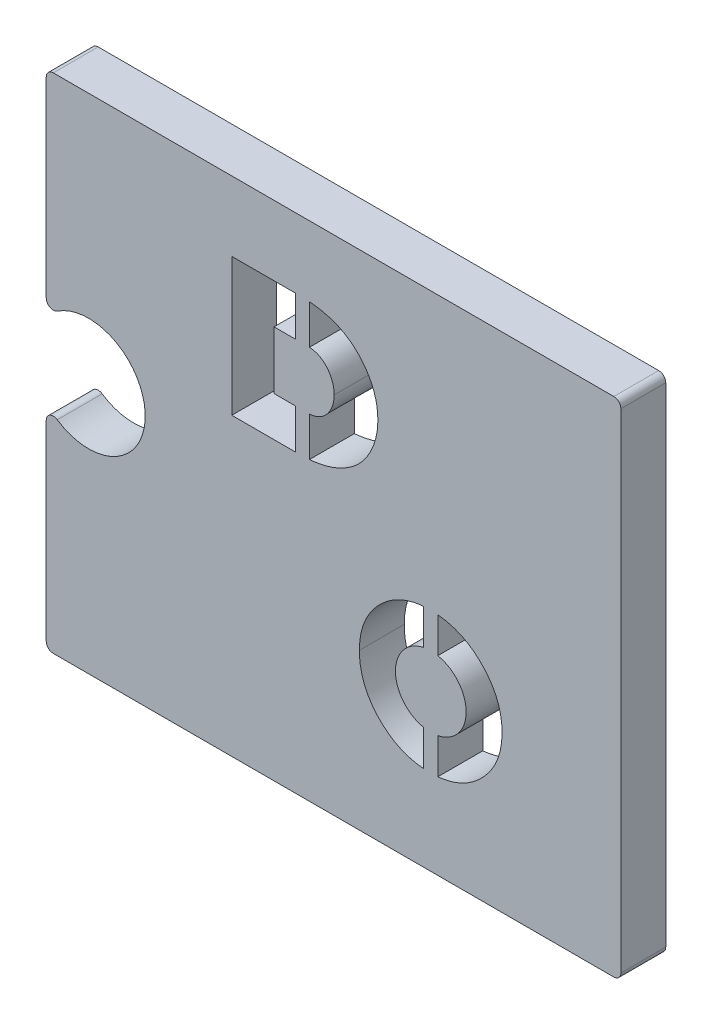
ISO-10303-21;
HEADER;
FILE_DESCRIPTION(('STEP AP214'),'2;1');
FILE_NAME('part.step','',(''),(''),'','','');
FILE_SCHEMA(('AUTOMOTIVE_DESIGN { 1 0 10303 214 1 1 1 1 }'));
ENDSEC;
DATA;
#1=APPLICATION_CONTEXT('core data for automotive mechanical design processes');
#2=APPLICATION_PROTOCOL_DEFINITION('international standard','automotive_design',2000,#1);
#3=PRODUCT_CONTEXT('',#1,'mechanical');
#4=PRODUCT('Part','Part','',(#3));
#5=PRODUCT_RELATED_PRODUCT_CATEGORY('part','',(#4));
#6=PRODUCT_DEFINITION_FORMATION('','',#4);
#7=PRODUCT_DEFINITION_CONTEXT('part definition',#1,'design');
#8=PRODUCT_DEFINITION('design','',#6,#7);
#9=PRODUCT_DEFINITION_SHAPE('','',#8);
#10=(LENGTH_UNIT() NAMED_UNIT(*) SI_UNIT(.MILLI.,.METRE.));
#11=(NAMED_UNIT(*) PLANE_ANGLE_UNIT() SI_UNIT($,.RADIAN.));
#12=(NAMED_UNIT(*) SI_UNIT($,.STERADIAN.) SOLID_ANGLE_UNIT());
#13=UNCERTAINTY_MEASURE_WITH_UNIT(LENGTH_MEASURE(1.E-05),#10,'distance_accuracy_value','');
#14=(GEOMETRIC_REPRESENTATION_CONTEXT(3) GLOBAL_UNCERTAINTY_ASSIGNED_CONTEXT((#13)) GLOBAL_UNIT_ASSIGNED_CONTEXT((#10,
#11,#12)) REPRESENTATION_CONTEXT('',''));
#15=CARTESIAN_POINT('',(0.,0.,0.));
#16=DIRECTION('',(0.,0.,1.));
#17=DIRECTION('',(1.,0.,0.));
#18=AXIS2_PLACEMENT_3D('',#15,#16,#17);
#19=CARTESIAN_POINT('',(27.1284344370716,15.9923597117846,0.));
#20=CARTESIAN_POINT('',(27.3063943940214,15.9883726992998,0.));
#21=CARTESIAN_POINT('',(27.6562112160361,15.9805354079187,0.));
#22=CARTESIAN_POINT('',(28.1690867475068,15.9086081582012,0.));
#23=CARTESIAN_POINT('',(28.6596188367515,15.79477309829,0.));
#24=CARTESIAN_POINT('',(29.1286467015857,15.6345730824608,0.));
#25=CARTESIAN_POINT('',(29.5749945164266,15.4269142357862,0.));
#26=CARTESIAN_POINT('',(30.0001720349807,15.1742108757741,0.));
#27=CARTESIAN_POINT('',(30.4011794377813,14.8735606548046,0.));
#28=CARTESIAN_POINT('',(30.7755188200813,14.5319241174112,0.));
#29=CARTESIAN_POINT('',(31.1161289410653,14.1594995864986,0.));
#30=CARTESIAN_POINT('',(31.4178400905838,13.7654828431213,0.));
#31=CARTESIAN_POINT('',(31.6712319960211,13.3518410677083,0.));
#32=CARTESIAN_POINT('',(31.8807727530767,12.9205026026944,0.));
#33=CARTESIAN_POINT('',(32.0398983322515,12.4698162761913,0.));
#34=CARTESIAN_POINT('',(32.1544605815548,12.0013984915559,0.));
#35=CARTESIAN_POINT('',(32.2265135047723,11.5147133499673,0.));
#36=CARTESIAN_POINT('',(32.2344440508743,11.1835742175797,0.));
#37=CARTESIAN_POINT('',(32.2384665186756,11.0156164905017,0.));
#38=B_SPLINE_CURVE_WITH_KNOTS('',3,(#19,#20,#21,#22,#23,#24,#25,#26,#27,#28,#29,#30,#31,#32,#33,
#34,#35,#36,#37),.UNSPECIFIED.,.F.,.F.,(4,1,1,1,1,1,1,1,1,1,1,1,1,1,1,1,4),(0.,
0.0671724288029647,0.132041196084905,0.195150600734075,0.257102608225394,0.31884694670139,
0.380732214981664,0.443544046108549,0.507780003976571,0.571841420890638,0.633898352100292,
0.694894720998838,0.754716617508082,0.814660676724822,0.875012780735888,0.936604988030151,1.),.UNSPECIFIED.);
#39=DIRECTION('',(0.,0.,1.));
#40=VECTOR('',#39,1.);
#41=SURFACE_OF_LINEAR_EXTRUSION('',#38,#40);
#42=CARTESIAN_POINT('',(27.1284344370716,15.9923597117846,3.175));
#43=CARTESIAN_POINT('',(27.3063943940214,15.9883726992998,3.175));
#44=CARTESIAN_POINT('',(27.6562112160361,15.9805354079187,3.175));
#45=CARTESIAN_POINT('',(28.1690867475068,15.9086081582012,3.175));
#46=CARTESIAN_POINT('',(28.6596188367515,15.79477309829,3.175));
#47=CARTESIAN_POINT('',(29.1286467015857,15.6345730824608,3.175));
#48=CARTESIAN_POINT('',(29.5749945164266,15.4269142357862,3.175));
#49=CARTESIAN_POINT('',(30.0001720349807,15.1742108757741,3.175));
#50=CARTESIAN_POINT('',(30.4011794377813,14.8735606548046,3.175));
#51=CARTESIAN_POINT('',(30.7755188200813,14.5319241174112,3.175));
#52=CARTESIAN_POINT('',(31.1161289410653,14.1594995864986,3.175));
#53=CARTESIAN_POINT('',(31.4178400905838,13.7654828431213,3.175));
#54=CARTESIAN_POINT('',(31.6712319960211,13.3518410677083,3.175));
#55=CARTESIAN_POINT('',(31.8807727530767,12.9205026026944,3.175));
#56=CARTESIAN_POINT('',(32.0398983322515,12.4698162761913,3.175));
#57=CARTESIAN_POINT('',(32.1544605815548,12.0013984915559,3.175));
#58=CARTESIAN_POINT('',(32.2265135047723,11.5147133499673,3.175));
#59=CARTESIAN_POINT('',(32.2344440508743,11.1835742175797,3.175));
#60=CARTESIAN_POINT('',(32.2384665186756,11.0156164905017,3.175));
#61=B_SPLINE_CURVE_WITH_KNOTS('',3,(#42,#43,#44,#45,#46,#47,#48,#49,#50,#51,#52,#53,#54,#55,#56,
#57,#58,#59,#60),.UNSPECIFIED.,.F.,.F.,(4,1,1,1,1,1,1,1,1,1,1,1,1,1,1,1,4),(0.,
0.0671724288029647,0.132041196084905,0.195150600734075,0.257102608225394,0.31884694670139,
0.380732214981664,0.443544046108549,0.507780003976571,0.571841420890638,0.633898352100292,
0.694894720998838,0.754716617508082,0.814660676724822,0.875012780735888,0.936604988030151,1.),.UNSPECIFIED.);
#62=CARTESIAN_POINT('',(27.6979200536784,15.966700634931,3.175));
#63=VERTEX_POINT('',#62);
#64=CARTESIAN_POINT('',(32.2384665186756,11.0156164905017,3.175));
#65=VERTEX_POINT('',#64);
#66=EDGE_CURVE('E460',#63,#65,#61,.T.);
#67=ORIENTED_EDGE('',*,*,#66,.F.);
#68=DIRECTION('',(0.,0.,1.));
#69=VECTOR('',#68,1.);
#70=CARTESIAN_POINT('',(27.6979200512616,15.9667006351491,0.));
#71=LINE('',#70,#69);
#72=CARTESIAN_POINT('',(27.6979200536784,15.966700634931,0.));
#73=VERTEX_POINT('',#72);
#74=EDGE_CURVE('E574',#63,#73,#71,.F.);
#75=ORIENTED_EDGE('',*,*,#74,.T.);
#76=CARTESIAN_POINT('',(32.2384665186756,11.0156164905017,0.));
#77=VERTEX_POINT('',#76);
#78=EDGE_CURVE('E411',#73,#77,#38,.T.);
#79=ORIENTED_EDGE('',*,*,#78,.T.);
#80=DIRECTION('',(0.,0.,1.));
#81=VECTOR('',#80,1.);
#82=CARTESIAN_POINT('',(32.2384665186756,11.0156164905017,0.));
#83=LINE('',#82,#81);
#84=EDGE_CURVE('E448',#77,#65,#83,.T.);
#85=ORIENTED_EDGE('',*,*,#84,.T.);
#86=EDGE_LOOP('',(#67,#75,#79,#85));
#87=FACE_BOUND('',#86,.T.);
#88=ADVANCED_FACE('F33',(#87),#41,.T.);
#89=CARTESIAN_POINT('',(32.2384665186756,11.0156164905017,0.));
#90=CARTESIAN_POINT('',(32.234451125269,10.8470310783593,0.));
#91=CARTESIAN_POINT('',(32.2265342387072,10.5146423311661,0.));
#92=CARTESIAN_POINT('',(32.1543738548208,10.026130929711,0.));
#93=CARTESIAN_POINT('',(32.0403572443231,9.55626451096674,0.));
#94=CARTESIAN_POINT('',(31.8798590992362,9.10427607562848,0.));
#95=CARTESIAN_POINT('',(31.6718685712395,8.67037963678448,0.));
#96=CARTESIAN_POINT('',(31.4177862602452,8.25457163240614,0.));
#97=CARTESIAN_POINT('',(31.1162231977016,7.8585850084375,0.));
#98=CARTESIAN_POINT('',(30.7754824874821,7.48442661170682,0.));
#99=CARTESIAN_POINT('',(30.4017705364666,7.14074816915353,0.));
#100=CARTESIAN_POINT('',(30.0001250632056,6.84016606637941,0.));
#101=CARTESIAN_POINT('',(29.5754259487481,6.58782677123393,0.));
#102=CARTESIAN_POINT('',(29.1292434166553,6.37938976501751,0.));
#103=CARTESIAN_POINT('',(28.6604935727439,6.21755740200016,0.));
#104=CARTESIAN_POINT('',(28.1690593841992,6.10393721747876,0.));
#105=CARTESIAN_POINT('',(27.6562184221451,6.03190198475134,0.));
#106=CARTESIAN_POINT('',(27.3063968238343,6.02407961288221,0.));
#107=CARTESIAN_POINT('',(27.1284344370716,6.02010019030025,0.));
#108=B_SPLINE_CURVE_WITH_KNOTS('',3,(#89,#90,#91,#92,#93,#94,#95,#96,#97,#98,#99,#100,#101,#102,
#103,#104,#105,#106,#107),.UNSPECIFIED.,.F.,.F.,(4,1,1,1,1,1,1,1,1,1,1,1,1,1,1,1,4),(0.,
0.0635081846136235,0.125214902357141,0.185679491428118,0.24550776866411,0.305639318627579,
0.366719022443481,0.42884396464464,0.492955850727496,0.557226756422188,0.619917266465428,
0.681683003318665,0.743094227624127,0.805226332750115,0.86821384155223,0.9329573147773,1.),.UNSPECIFIED.);
#109=DIRECTION('',(0.,0.,1.));
#110=VECTOR('',#109,1.);
#111=SURFACE_OF_LINEAR_EXTRUSION('',#108,#110);
#112=CARTESIAN_POINT('',(27.6979200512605,6.04576275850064,0.));
#113=VERTEX_POINT('',#112);
#114=EDGE_CURVE('E451',#77,#113,#108,.T.);
#115=ORIENTED_EDGE('',*,*,#114,.T.);
#116=DIRECTION('',(0.,0.,1.));
#117=VECTOR('',#116,1.);
#118=CARTESIAN_POINT('',(27.6979200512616,6.04576275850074,0.));
#119=LINE('',#118,#117);
#120=CARTESIAN_POINT('',(27.6979200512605,6.04576275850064,3.175));
#121=VERTEX_POINT('',#120);
#122=EDGE_CURVE('E572',#113,#121,#119,.T.);
#123=ORIENTED_EDGE('',*,*,#122,.T.);
#124=CARTESIAN_POINT('',(32.2384665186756,11.0156164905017,3.175));
#125=CARTESIAN_POINT('',(32.234451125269,10.8470310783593,3.175));
#126=CARTESIAN_POINT('',(32.2265342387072,10.5146423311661,3.175));
#127=CARTESIAN_POINT('',(32.1543738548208,10.026130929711,3.175));
#128=CARTESIAN_POINT('',(32.0403572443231,9.55626451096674,3.175));
#129=CARTESIAN_POINT('',(31.8798590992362,9.10427607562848,3.175));
#130=CARTESIAN_POINT('',(31.6718685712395,8.67037963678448,3.175));
#131=CARTESIAN_POINT('',(31.4177862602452,8.25457163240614,3.175));
#132=CARTESIAN_POINT('',(31.1162231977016,7.8585850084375,3.175));
#133=CARTESIAN_POINT('',(30.7754824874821,7.48442661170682,3.175));
#134=CARTESIAN_POINT('',(30.4017705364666,7.14074816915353,3.175));
#135=CARTESIAN_POINT('',(30.0001250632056,6.84016606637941,3.175));
#136=CARTESIAN_POINT('',(29.5754259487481,6.58782677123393,3.175));
#137=CARTESIAN_POINT('',(29.1292434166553,6.37938976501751,3.175));
#138=CARTESIAN_POINT('',(28.6604935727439,6.21755740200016,3.175));
#139=CARTESIAN_POINT('',(28.1690593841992,6.10393721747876,3.175));
#140=CARTESIAN_POINT('',(27.6562184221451,6.03190198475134,3.175));
#141=CARTESIAN_POINT('',(27.3063968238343,6.02407961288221,3.175));
#142=CARTESIAN_POINT('',(27.1284344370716,6.02010019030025,3.175));
#143=B_SPLINE_CURVE_WITH_KNOTS('',3,(#124,#125,#126,#127,#128,#129,#130,#131,#132,#133,#134,
#135,#136,#137,#138,#139,#140,#141,#142),.UNSPECIFIED.,.F.,.F.,(4,1,1,1,1,1,1,1,1,1,1,1,1,1,1,1,
4),(0.,0.0635081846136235,0.125214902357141,0.185679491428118,0.24550776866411,
0.305639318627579,0.366719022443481,0.42884396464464,0.492955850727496,0.557226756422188,
0.619917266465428,0.681683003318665,0.743094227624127,0.805226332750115,0.86821384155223,
0.9329573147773,1.),.UNSPECIFIED.);
#144=EDGE_CURVE('E468',#65,#121,#143,.T.);
#145=ORIENTED_EDGE('',*,*,#144,.F.);
#146=ORIENTED_EDGE('',*,*,#84,.F.);
#147=EDGE_LOOP('',(#115,#123,#145,#146));
#148=FACE_BOUND('',#147,.T.);
#149=ADVANCED_FACE('F537',(#148),#111,.T.);
#150=CARTESIAN_POINT('',(27.1284344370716,6.02010019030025,0.));
#151=CARTESIAN_POINT('',(26.958006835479,6.02433910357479,0.));
#152=CARTESIAN_POINT('',(26.6220359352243,6.03269544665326,0.));
#153=CARTESIAN_POINT('',(26.1275420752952,6.10163389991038,0.));
#154=CARTESIAN_POINT('',(25.6537215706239,6.21636958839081,0.));
#155=CARTESIAN_POINT('',(25.198836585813,6.37434691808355,0.));
#156=CARTESIAN_POINT('',(24.7653509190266,6.5808355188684,0.));
#157=CARTESIAN_POINT('',(24.3506501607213,6.83137301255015,0.));
#158=CARTESIAN_POINT('',(23.9567157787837,7.12806926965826,0.));
#159=CARTESIAN_POINT('',(23.5878798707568,7.46631674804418,0.));
#160=CARTESIAN_POINT('',(23.2505562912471,7.83562235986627,0.));
#161=CARTESIAN_POINT('',(22.9558753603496,8.23101227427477,0.));
#162=CARTESIAN_POINT('',(22.7036864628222,8.64477578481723,0.));
#163=CARTESIAN_POINT('',(22.5015099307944,9.08142547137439,0.));
#164=CARTESIAN_POINT('',(22.3394505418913,9.53583665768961,0.));
#165=CARTESIAN_POINT('',(22.2281873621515,10.0119351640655,0.));
#166=CARTESIAN_POINT('',(22.1584739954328,10.5072964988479,0.));
#167=CARTESIAN_POINT('',(22.1502373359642,10.8445464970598,0.));
#168=CARTESIAN_POINT('',(22.1460592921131,11.0156164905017,0.));
#169=B_SPLINE_CURVE_WITH_KNOTS('',3,(#150,#151,#152,#153,#154,#155,#156,#157,#158,#159,#160,
#161,#162,#163,#164,#165,#166,#167,#168),.UNSPECIFIED.,.F.,.F.,(4,1,1,1,1,1,1,1,1,1,1,1,1,1,1,1,
4),(0.,0.0650303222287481,0.128196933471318,0.190125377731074,0.250858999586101,
0.311651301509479,0.373054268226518,0.43548960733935,0.499564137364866,0.563815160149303,
0.626107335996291,0.68751030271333,0.748416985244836,0.809455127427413,0.871327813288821,
0.934731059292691,1.),.UNSPECIFIED.);
#170=DIRECTION('',(0.,0.,1.));
#171=VECTOR('',#170,1.);
#172=SURFACE_OF_LINEAR_EXTRUSION('',#169,#171);
#173=CARTESIAN_POINT('',(27.1284344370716,6.02010019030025,3.175));
#174=CARTESIAN_POINT('',(26.958006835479,6.02433910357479,3.175));
#175=CARTESIAN_POINT('',(26.6220359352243,6.03269544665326,3.175));
#176=CARTESIAN_POINT('',(26.1275420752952,6.10163389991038,3.175));
#177=CARTESIAN_POINT('',(25.6537215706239,6.21636958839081,3.175));
#178=CARTESIAN_POINT('',(25.198836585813,6.37434691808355,3.175));
#179=CARTESIAN_POINT('',(24.7653509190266,6.5808355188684,3.175));
#180=CARTESIAN_POINT('',(24.3506501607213,6.83137301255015,3.175));
#181=CARTESIAN_POINT('',(23.9567157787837,7.12806926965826,3.175));
#182=CARTESIAN_POINT('',(23.5878798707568,7.46631674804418,3.175));
#183=CARTESIAN_POINT('',(23.2505562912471,7.83562235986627,3.175));
#184=CARTESIAN_POINT('',(22.9558753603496,8.23101227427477,3.175));
#185=CARTESIAN_POINT('',(22.7036864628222,8.64477578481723,3.175));
#186=CARTESIAN_POINT('',(22.5015099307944,9.08142547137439,3.175));
#187=CARTESIAN_POINT('',(22.3394505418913,9.53583665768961,3.175));
#188=CARTESIAN_POINT('',(22.2281873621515,10.0119351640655,3.175));
#189=CARTESIAN_POINT('',(22.1584739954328,10.5072964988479,3.175));
#190=CARTESIAN_POINT('',(22.1502373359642,10.8445464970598,3.175));
#191=CARTESIAN_POINT('',(22.1460592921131,11.0156164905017,3.175));
#192=B_SPLINE_CURVE_WITH_KNOTS('',3,(#173,#174,#175,#176,#177,#178,#179,#180,#181,#182,#183,
#184,#185,#186,#187,#188,#189,#190,#191),.UNSPECIFIED.,.F.,.F.,(4,1,1,1,1,1,1,1,1,1,1,1,1,1,1,1,
4),(0.,0.0650303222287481,0.128196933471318,0.190125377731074,0.250858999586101,
0.311651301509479,0.373054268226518,0.43548960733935,0.499564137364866,0.563815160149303,
0.626107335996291,0.68751030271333,0.748416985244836,0.809455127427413,0.871327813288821,
0.934731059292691,1.),.UNSPECIFIED.);
#193=CARTESIAN_POINT('',(26.6979200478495,6.0366910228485,3.175));
#194=VERTEX_POINT('',#193);
#195=CARTESIAN_POINT('',(22.1460592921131,11.0156164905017,3.175));
#196=VERTEX_POINT('',#195);
#197=EDGE_CURVE('E461',#194,#196,#192,.T.);
#198=ORIENTED_EDGE('',*,*,#197,.F.);
#199=DIRECTION('',(0.,0.,1.));
#200=VECTOR('',#199,1.);
#201=CARTESIAN_POINT('',(26.6979200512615,6.0366910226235,0.));
#202=LINE('',#201,#200);
#203=CARTESIAN_POINT('',(26.6979200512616,6.03669102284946,0.));
#204=VERTEX_POINT('',#203);
#205=EDGE_CURVE('E569',#194,#204,#202,.F.);
#206=ORIENTED_EDGE('',*,*,#205,.T.);
#207=CARTESIAN_POINT('',(22.1460592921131,11.0156164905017,0.));
#208=VERTEX_POINT('',#207);
#209=EDGE_CURVE('E456',#204,#208,#169,.T.);
#210=ORIENTED_EDGE('',*,*,#209,.T.);
#211=DIRECTION('',(0.,0.,1.));
#212=VECTOR('',#211,1.);
#213=CARTESIAN_POINT('',(22.1460592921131,11.0156164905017,0.));
#214=LINE('',#213,#212);
#215=EDGE_CURVE('E452',#208,#196,#214,.T.);
#216=ORIENTED_EDGE('',*,*,#215,.T.);
#217=EDGE_LOOP('',(#198,#206,#210,#216));
#218=FACE_BOUND('',#217,.T.);
#219=ADVANCED_FACE('F503',(#218),#172,.T.);
#220=CARTESIAN_POINT('',(22.1460592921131,11.0156164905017,0.));
#221=CARTESIAN_POINT('',(22.1503144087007,11.1860400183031,0.));
#222=CARTESIAN_POINT('',(22.1587026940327,11.5220028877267,0.));
#223=CARTESIAN_POINT('',(22.2273244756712,12.0159514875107,0.));
#224=CARTESIAN_POINT('',(22.3426830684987,12.4889830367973,0.));
#225=CARTESIAN_POINT('',(22.5002011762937,12.9433901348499,0.));
#226=CARTESIAN_POINT('',(22.7066914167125,13.3758768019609,0.));
#227=CARTESIAN_POINT('',(22.9551699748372,13.7902726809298,0.));
#228=CARTESIAN_POINT('',(23.2528036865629,14.1818721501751,0.));
#229=CARTESIAN_POINT('',(23.590280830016,14.5499458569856,0.));
#230=CARTESIAN_POINT('',(23.9579218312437,14.8884461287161,0.));
#231=CARTESIAN_POINT('',(24.3532636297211,15.1825153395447,0.));
#232=CARTESIAN_POINT('',(24.7665752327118,15.4342554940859,0.));
#233=CARTESIAN_POINT('',(25.2016877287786,15.6369573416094,0.));
#234=CARTESIAN_POINT('',(25.6542667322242,15.7989477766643,0.));
#235=CARTESIAN_POINT('',(26.1284881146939,15.9102379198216,0.));
#236=CARTESIAN_POINT('',(26.6219845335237,15.9799453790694,0.));
#237=CARTESIAN_POINT('',(26.9579895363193,15.9881816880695,0.));
#238=CARTESIAN_POINT('',(27.1284344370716,15.9923597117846,0.));
#239=B_SPLINE_CURVE_WITH_KNOTS('',3,(#220,#221,#222,#223,#224,#225,#226,#227,#228,#229,#230,
#231,#232,#233,#234,#235,#236,#237,#238),.UNSPECIFIED.,.F.,.F.,(4,1,1,1,1,1,1,1,1,1,1,1,1,1,1,1,
4),(0.,0.0651656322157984,0.128463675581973,0.190288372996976,0.251148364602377,
0.312067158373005,0.373269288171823,0.435643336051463,0.499851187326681,0.564059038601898,
0.626480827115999,0.688011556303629,0.748828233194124,0.809767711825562,0.871536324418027,
0.934834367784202,1.),.UNSPECIFIED.);
#240=DIRECTION('',(0.,0.,1.));
#241=VECTOR('',#240,1.);
#242=SURFACE_OF_LINEAR_EXTRUSION('',#239,#241);
#243=CARTESIAN_POINT('',(26.697920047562,15.9758143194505,0.));
#244=VERTEX_POINT('',#243);
#245=EDGE_CURVE('E455',#208,#244,#239,.T.);
#246=ORIENTED_EDGE('',*,*,#245,.T.);
#247=DIRECTION('',(0.,0.,1.));
#248=VECTOR('',#247,1.);
#249=CARTESIAN_POINT('',(26.6979200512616,15.975814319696,0.));
#250=LINE('',#249,#248);
#251=CARTESIAN_POINT('',(26.697920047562,15.9758143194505,3.175));
#252=VERTEX_POINT('',#251);
#253=EDGE_CURVE('E567',#244,#252,#250,.T.);
#254=ORIENTED_EDGE('',*,*,#253,.T.);
#255=CARTESIAN_POINT('',(22.1460592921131,11.0156164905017,3.175));
#256=CARTESIAN_POINT('',(22.1503144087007,11.1860400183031,3.175));
#257=CARTESIAN_POINT('',(22.1587026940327,11.5220028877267,3.175));
#258=CARTESIAN_POINT('',(22.2273244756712,12.0159514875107,3.175));
#259=CARTESIAN_POINT('',(22.3426830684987,12.4889830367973,3.175));
#260=CARTESIAN_POINT('',(22.5002011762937,12.9433901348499,3.175));
#261=CARTESIAN_POINT('',(22.7066914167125,13.3758768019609,3.175));
#262=CARTESIAN_POINT('',(22.9551699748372,13.7902726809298,3.175));
#263=CARTESIAN_POINT('',(23.2528036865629,14.1818721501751,3.175));
#264=CARTESIAN_POINT('',(23.590280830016,14.5499458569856,3.175));
#265=CARTESIAN_POINT('',(23.9579218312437,14.8884461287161,3.175));
#266=CARTESIAN_POINT('',(24.3532636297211,15.1825153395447,3.175));
#267=CARTESIAN_POINT('',(24.7665752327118,15.4342554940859,3.175));
#268=CARTESIAN_POINT('',(25.2016877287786,15.6369573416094,3.175));
#269=CARTESIAN_POINT('',(25.6542667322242,15.7989477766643,3.175));
#270=CARTESIAN_POINT('',(26.1284881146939,15.9102379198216,3.175));
#271=CARTESIAN_POINT('',(26.6219845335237,15.9799453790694,3.175));
#272=CARTESIAN_POINT('',(26.9579895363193,15.9881816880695,3.175));
#273=CARTESIAN_POINT('',(27.1284344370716,15.9923597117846,3.175));
#274=B_SPLINE_CURVE_WITH_KNOTS('',3,(#255,#256,#257,#258,#259,#260,#261,#262,#263,#264,#265,
#266,#267,#268,#269,#270,#271,#272,#273),.UNSPECIFIED.,.F.,.F.,(4,1,1,1,1,1,1,1,1,1,1,1,1,1,1,1,
4),(0.,0.0651656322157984,0.128463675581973,0.190288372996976,0.251148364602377,
0.312067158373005,0.373269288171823,0.435643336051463,0.499851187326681,0.564059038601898,
0.626480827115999,0.688011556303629,0.748828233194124,0.809767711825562,0.871536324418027,
0.934834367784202,1.),.UNSPECIFIED.);
#275=EDGE_CURVE('E275',#196,#252,#274,.T.);
#276=ORIENTED_EDGE('',*,*,#275,.F.);
#277=ORIENTED_EDGE('',*,*,#215,.F.);
#278=EDGE_LOOP('',(#246,#254,#276,#277));
#279=FACE_BOUND('',#278,.T.);
#280=ADVANCED_FACE('F498',(#279),#242,.T.);
#281=CARTESIAN_POINT('',(23.4550039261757,25.7470741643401,0.));
#282=CARTESIAN_POINT('',(23.453323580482,25.6431258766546,0.));
#283=CARTESIAN_POINT('',(23.4499659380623,25.4354179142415,0.));
#284=CARTESIAN_POINT('',(23.4190092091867,25.1261776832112,0.));
#285=CARTESIAN_POINT('',(23.368265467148,24.8201228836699,0.));
#286=CARTESIAN_POINT('',(23.2963191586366,24.5181394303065,0.));
#287=CARTESIAN_POINT('',(23.2065699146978,24.2186965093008,0.));
#288=CARTESIAN_POINT('',(23.0949372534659,23.9229243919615,0.));
#289=CARTESIAN_POINT('',(22.9635298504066,23.6309884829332,0.));
#290=CARTESIAN_POINT('',(22.814239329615,23.3434313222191,0.));
#291=CARTESIAN_POINT('',(22.6433078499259,23.0663651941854,0.));
#292=CARTESIAN_POINT('',(22.454523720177,22.8007157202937,0.));
#293=CARTESIAN_POINT('',(22.2434027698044,22.5527308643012,0.));
#294=CARTESIAN_POINT('',(22.012498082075,22.320566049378,0.));
#295=CARTESIAN_POINT('',(21.7633272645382,22.1028232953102,0.));
#296=CARTESIAN_POINT('',(21.4932276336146,21.9011325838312,0.));
#297=CARTESIAN_POINT('',(21.2035127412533,21.7157915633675,0.));
#298=CARTESIAN_POINT('',(20.8957960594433,21.5442774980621,0.));
#299=CARTESIAN_POINT('',(20.5694394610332,21.392695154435,0.));
#300=CARTESIAN_POINT('',(20.2260276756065,21.2615015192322,0.));
#301=CARTESIAN_POINT('',(19.8673268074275,21.1476926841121,0.));
#302=CARTESIAN_POINT('',(19.4903918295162,21.0592076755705,0.));
#303=CARTESIAN_POINT('',(19.0976788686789,20.9869590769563,0.));
#304=CARTESIAN_POINT('',(18.688215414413,20.938034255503,0.));
#305=CARTESIAN_POINT('',(18.2629486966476,20.9039013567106,0.));
#306=CARTESIAN_POINT('',(17.9739618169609,20.9012268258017,0.));
#307=CARTESIAN_POINT('',(17.8268348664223,20.8998651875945,0.));
#308=B_SPLINE_CURVE_WITH_KNOTS('',3,(#281,#282,#283,#284,#285,#286,#287,#288,#289,#290,#291,
#292,#293,#294,#295,#296,#297,#298,#299,#300,#301,#302,#303,#304,#305,#306,#307),.UNSPECIFIED.,
.F.,.F.,(4,1,1,1,1,1,1,1,1,1,1,1,1,1,1,1,1,1,1,1,1,1,1,1,4),(0.,0.0373640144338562,
0.074660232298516,0.111610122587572,0.148827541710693,0.186194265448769,0.223928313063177,
0.262397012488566,0.301240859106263,0.340328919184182,0.379350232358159,0.418297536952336,
0.457274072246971,0.496978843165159,0.537160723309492,0.578349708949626,0.620546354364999,
0.663727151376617,0.707598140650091,0.752640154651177,0.798914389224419,0.846706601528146,
0.896127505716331,0.947117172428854,1.),.UNSPECIFIED.);
#309=DIRECTION('',(0.,0.,1.));
#310=VECTOR('',#309,1.);
#311=SURFACE_OF_LINEAR_EXTRUSION('',#308,#310);
#312=CARTESIAN_POINT('',(23.4550039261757,25.7470741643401,0.));
#313=VERTEX_POINT('',#312);
#314=CARTESIAN_POINT('',(18.6131285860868,20.9335486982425,0.));
#315=VERTEX_POINT('',#314);
#316=EDGE_CURVE('E396',#313,#315,#308,.T.);
#317=ORIENTED_EDGE('',*,*,#316,.T.);
#318=DIRECTION('',(0.,0.,1.));
#319=VECTOR('',#318,1.);
#320=CARTESIAN_POINT('',(18.6131285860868,20.9335486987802,0.));
#321=LINE('',#320,#319);
#322=CARTESIAN_POINT('',(18.6131285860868,20.9335486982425,3.175));
#323=VERTEX_POINT('',#322);
#324=EDGE_CURVE('E564',#315,#323,#321,.T.);
#325=ORIENTED_EDGE('',*,*,#324,.T.);
#326=CARTESIAN_POINT('',(23.4550039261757,25.7470741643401,3.175));
#327=CARTESIAN_POINT('',(23.453323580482,25.6431258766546,3.175));
#328=CARTESIAN_POINT('',(23.4499659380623,25.4354179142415,3.175));
#329=CARTESIAN_POINT('',(23.4190092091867,25.1261776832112,3.175));
#330=CARTESIAN_POINT('',(23.368265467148,24.8201228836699,3.175));
#331=CARTESIAN_POINT('',(23.2963191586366,24.5181394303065,3.175));
#332=CARTESIAN_POINT('',(23.2065699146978,24.2186965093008,3.175));
#333=CARTESIAN_POINT('',(23.0949372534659,23.9229243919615,3.175));
#334=CARTESIAN_POINT('',(22.9635298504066,23.6309884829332,3.175));
#335=CARTESIAN_POINT('',(22.814239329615,23.3434313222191,3.175));
#336=CARTESIAN_POINT('',(22.6433078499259,23.0663651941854,3.175));
#337=CARTESIAN_POINT('',(22.454523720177,22.8007157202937,3.175));
#338=CARTESIAN_POINT('',(22.2434027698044,22.5527308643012,3.175));
#339=CARTESIAN_POINT('',(22.012498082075,22.320566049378,3.175));
#340=CARTESIAN_POINT('',(21.7633272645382,22.1028232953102,3.175));
#341=CARTESIAN_POINT('',(21.4932276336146,21.9011325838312,3.175));
#342=CARTESIAN_POINT('',(21.2035127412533,21.7157915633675,3.175));
#343=CARTESIAN_POINT('',(20.8957960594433,21.5442774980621,3.175));
#344=CARTESIAN_POINT('',(20.5694394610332,21.392695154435,3.175));
#345=CARTESIAN_POINT('',(20.2260276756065,21.2615015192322,3.175));
#346=CARTESIAN_POINT('',(19.8673268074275,21.1476926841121,3.175));
#347=CARTESIAN_POINT('',(19.4903918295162,21.0592076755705,3.175));
#348=CARTESIAN_POINT('',(19.0976788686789,20.9869590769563,3.175));
#349=CARTESIAN_POINT('',(18.688215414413,20.938034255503,3.175));
#350=CARTESIAN_POINT('',(18.2629486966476,20.9039013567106,3.175));
#351=CARTESIAN_POINT('',(17.9739618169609,20.9012268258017,3.175));
#352=CARTESIAN_POINT('',(17.8268348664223,20.8998651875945,3.175));
#353=B_SPLINE_CURVE_WITH_KNOTS('',3,(#326,#327,#328,#329,#330,#331,#332,#333,#334,#335,#336,
#337,#338,#339,#340,#341,#342,#343,#344,#345,#346,#347,#348,#349,#350,#351,#352),.UNSPECIFIED.,
.F.,.F.,(4,1,1,1,1,1,1,1,1,1,1,1,1,1,1,1,1,1,1,1,1,1,1,1,4),(0.,0.0373640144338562,
0.074660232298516,0.111610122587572,0.148827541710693,0.186194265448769,0.223928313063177,
0.262397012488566,0.301240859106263,0.340328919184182,0.379350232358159,0.418297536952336,
0.457274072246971,0.496978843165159,0.537160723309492,0.578349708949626,0.620546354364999,
0.663727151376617,0.707598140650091,0.752640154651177,0.798914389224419,0.846706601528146,
0.896127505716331,0.947117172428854,1.),.UNSPECIFIED.);
#354=CARTESIAN_POINT('',(23.4550039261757,25.7470741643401,3.175));
#355=VERTEX_POINT('',#354);
#356=EDGE_CURVE('E379',#355,#323,#353,.T.);
#357=ORIENTED_EDGE('',*,*,#356,.F.);
#358=DIRECTION('',(0.,0.,1.));
#359=VECTOR('',#358,1.);
#360=CARTESIAN_POINT('',(23.4550039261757,25.7470741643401,0.));
#361=LINE('',#360,#359);
#362=EDGE_CURVE('E375',#313,#355,#361,.T.);
#363=ORIENTED_EDGE('',*,*,#362,.F.);
#364=EDGE_LOOP('',(#317,#325,#357,#363));
#365=FACE_BOUND('',#364,.T.);
#366=ADVANCED_FACE('F502',(#365),#311,.T.);
#367=CARTESIAN_POINT('',(3.,20.8998651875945,0.));
#368=DIRECTION('',(0.,-1.,0.));
#369=DIRECTION('',(0.,0.,-1.));
#370=AXIS2_PLACEMENT_3D('',#367,#368,#369);
#371=PLANE('',#370);
#372=DIRECTION('',(0.,0.,1.));
#373=VECTOR('',#372,1.);
#374=CARTESIAN_POINT('',(17.6131285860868,20.8998651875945,0.));
#375=LINE('',#374,#373);
#376=CARTESIAN_POINT('',(17.6131285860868,20.8998651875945,0.));
#377=VERTEX_POINT('',#376);
#378=CARTESIAN_POINT('',(17.6131285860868,20.8998651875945,3.175));
#379=VERTEX_POINT('',#378);
#380=EDGE_CURVE('E562',#377,#379,#375,.T.);
#381=ORIENTED_EDGE('',*,*,#380,.F.);
#382=DIRECTION('',(1.,0.,0.));
#383=VECTOR('',#382,1.);
#384=CARTESIAN_POINT('',(3.,20.8998651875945,0.));
#385=LINE('',#384,#383);
#386=CARTESIAN_POINT('',(13.122301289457,20.8998651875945,0.));
#387=VERTEX_POINT('',#386);
#388=EDGE_CURVE('E434',#387,#377,#385,.T.);
#389=ORIENTED_EDGE('',*,*,#388,.F.);
#390=DIRECTION('',(0.,0.,1.));
#391=VECTOR('',#390,1.);
#392=CARTESIAN_POINT('',(13.122301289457,20.8998651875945,0.));
#393=LINE('',#392,#391);
#394=CARTESIAN_POINT('',(13.122301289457,20.8998651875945,3.175));
#395=VERTEX_POINT('',#394);
#396=EDGE_CURVE('E395',#387,#395,#393,.T.);
#397=ORIENTED_EDGE('',*,*,#396,.T.);
#398=DIRECTION('',(1.,0.,0.));
#399=VECTOR('',#398,1.);
#400=CARTESIAN_POINT('',(3.,20.8998651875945,3.175));
#401=LINE('',#400,#399);
#402=EDGE_CURVE('E389',#395,#379,#401,.T.);
#403=ORIENTED_EDGE('',*,*,#402,.T.);
#404=EDGE_LOOP('',(#381,#389,#397,#403));
#405=FACE_BOUND('',#404,.T.);
#406=ADVANCED_FACE('F698',(#405),#371,.F.);
#407=CARTESIAN_POINT('',(3.,30.6318292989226,0.));
#408=DIRECTION('',(0.,1.,0.));
#409=DIRECTION('',(0.,0.,1.));
#410=AXIS2_PLACEMENT_3D('',#407,#408,#409);
#411=PLANE('',#410);
#412=DIRECTION('',(0.,0.,-1.));
#413=VECTOR('',#412,1.);
#414=CARTESIAN_POINT('',(17.6131285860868,30.6318292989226,0.));
#415=LINE('',#414,#413);
#416=CARTESIAN_POINT('',(17.6131285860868,30.6318292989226,3.175));
#417=VERTEX_POINT('',#416);
#418=CARTESIAN_POINT('',(17.6131285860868,30.6318292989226,0.));
#419=VERTEX_POINT('',#418);
#420=EDGE_CURVE('E559',#417,#419,#415,.T.);
#421=ORIENTED_EDGE('',*,*,#420,.F.);
#422=DIRECTION('',(-1.,0.,0.));
#423=VECTOR('',#422,1.);
#424=CARTESIAN_POINT('',(3.,30.6318292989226,3.175));
#425=LINE('',#424,#423);
#426=CARTESIAN_POINT('',(13.122301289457,30.6318292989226,3.175));
#427=VERTEX_POINT('',#426);
#428=EDGE_CURVE('E376',#417,#427,#425,.T.);
#429=ORIENTED_EDGE('',*,*,#428,.T.);
#430=DIRECTION('',(0.,0.,1.));
#431=VECTOR('',#430,1.);
#432=CARTESIAN_POINT('',(13.122301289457,30.6318292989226,0.));
#433=LINE('',#432,#431);
#434=CARTESIAN_POINT('',(13.122301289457,30.6318292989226,0.));
#435=VERTEX_POINT('',#434);
#436=EDGE_CURVE('E400',#435,#427,#433,.T.);
#437=ORIENTED_EDGE('',*,*,#436,.F.);
#438=DIRECTION('',(-1.,0.,0.));
#439=VECTOR('',#438,1.);
#440=CARTESIAN_POINT('',(3.,30.6318292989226,0.));
#441=LINE('',#440,#439);
#442=EDGE_CURVE('E377',#419,#435,#441,.T.);
#443=ORIENTED_EDGE('',*,*,#442,.F.);
#444=EDGE_LOOP('',(#421,#429,#437,#443));
#445=FACE_BOUND('',#444,.T.);
#446=ADVANCED_FACE('F366',(#445),#411,.F.);
#447=CARTESIAN_POINT('',(17.9263321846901,30.6318292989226,0.));
#448=CARTESIAN_POINT('',(18.0358625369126,30.6307665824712,0.));
#449=CARTESIAN_POINT('',(18.2519271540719,30.6286702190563,0.));
#450=CARTESIAN_POINT('',(18.5706933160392,30.6115285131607,0.));
#451=CARTESIAN_POINT('',(18.8799991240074,30.5831440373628,0.));
#452=CARTESIAN_POINT('',(19.1797050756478,30.5450275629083,0.));
#453=CARTESIAN_POINT('',(19.4692449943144,30.491057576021,0.));
#454=CARTESIAN_POINT('',(19.7495687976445,30.4300726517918,0.));
#455=CARTESIAN_POINT('',(20.0201121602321,30.3564608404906,0.));
#456=CARTESIAN_POINT('',(20.2819874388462,30.272855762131,0.));
#457=CARTESIAN_POINT('',(20.5328803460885,30.1738600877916,0.));
#458=CARTESIAN_POINT('',(20.776272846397,30.0686969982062,0.));
#459=CARTESIAN_POINT('',(21.0069961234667,29.9461519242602,0.));
#460=CARTESIAN_POINT('',(21.2314323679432,29.8185432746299,0.));
#461=CARTESIAN_POINT('',(21.4436206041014,29.6746067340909,0.));
#462=CARTESIAN_POINT('',(21.6461089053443,29.5204359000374,0.));
#463=CARTESIAN_POINT('',(21.8411373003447,29.3571170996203,0.));
#464=CARTESIAN_POINT('',(22.0829602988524,29.1230272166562,0.));
#465=CARTESIAN_POINT('',(22.3605826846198,28.8161018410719,0.));
#466=CARTESIAN_POINT('',(22.6540169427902,28.4279556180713,0.));
#467=CARTESIAN_POINT('',(22.90170651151,28.0225418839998,0.));
#468=CARTESIAN_POINT('',(23.1030827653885,27.5994324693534,0.));
#469=CARTESIAN_POINT('',(23.262988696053,27.1605082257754,0.));
#470=CARTESIAN_POINT('',(23.3720603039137,26.7030820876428,0.));
#471=CARTESIAN_POINT('',(23.4425965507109,26.2304854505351,0.));
#472=CARTESIAN_POINT('',(23.4508375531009,25.9094027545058,0.));
#473=CARTESIAN_POINT('',(23.4550039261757,25.7470741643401,0.));
#474=B_SPLINE_CURVE_WITH_KNOTS('',3,(#447,#448,#449,#450,#451,#452,#453,#454,#455,#456,#457,
#458,#459,#460,#461,#462,#463,#464,#465,#466,#467,#468,#469,#470,#471,#472,#473),.UNSPECIFIED.,
.F.,.F.,(4,1,1,1,1,1,1,1,1,1,1,1,1,1,1,1,1,1,1,1,1,1,1,1,4),(0.,0.0396571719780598,
0.0782295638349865,0.115543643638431,0.152107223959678,0.187572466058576,0.22215084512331,
0.255953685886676,0.289057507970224,0.321625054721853,0.353579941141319,0.384996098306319,
0.416163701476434,0.447019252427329,0.477743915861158,0.508292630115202,0.539060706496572,
0.599538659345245,0.657950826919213,0.714995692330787,0.77124256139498,0.827361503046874,
0.883799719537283,0.941253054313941,1.),.UNSPECIFIED.);
#475=DIRECTION('',(0.,0.,1.));
#476=VECTOR('',#475,1.);
#477=SURFACE_OF_LINEAR_EXTRUSION('',#474,#476);
#478=CARTESIAN_POINT('',(17.9263321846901,30.6318292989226,3.175));
#479=CARTESIAN_POINT('',(18.0358625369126,30.6307665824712,3.175));
#480=CARTESIAN_POINT('',(18.2519271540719,30.6286702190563,3.175));
#481=CARTESIAN_POINT('',(18.5706933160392,30.6115285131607,3.175));
#482=CARTESIAN_POINT('',(18.8799991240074,30.5831440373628,3.175));
#483=CARTESIAN_POINT('',(19.1797050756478,30.5450275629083,3.175));
#484=CARTESIAN_POINT('',(19.4692449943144,30.491057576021,3.175));
#485=CARTESIAN_POINT('',(19.7495687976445,30.4300726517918,3.175));
#486=CARTESIAN_POINT('',(20.0201121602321,30.3564608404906,3.175));
#487=CARTESIAN_POINT('',(20.2819874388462,30.272855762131,3.175));
#488=CARTESIAN_POINT('',(20.5328803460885,30.1738600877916,3.175));
#489=CARTESIAN_POINT('',(20.776272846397,30.0686969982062,3.175));
#490=CARTESIAN_POINT('',(21.0069961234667,29.9461519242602,3.175));
#491=CARTESIAN_POINT('',(21.2314323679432,29.8185432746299,3.175));
#492=CARTESIAN_POINT('',(21.4436206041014,29.6746067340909,3.175));
#493=CARTESIAN_POINT('',(21.6461089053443,29.5204359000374,3.175));
#494=CARTESIAN_POINT('',(21.8411373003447,29.3571170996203,3.175));
#495=CARTESIAN_POINT('',(22.0829602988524,29.1230272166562,3.175));
#496=CARTESIAN_POINT('',(22.3605826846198,28.8161018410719,3.175));
#497=CARTESIAN_POINT('',(22.6540169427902,28.4279556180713,3.175));
#498=CARTESIAN_POINT('',(22.90170651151,28.0225418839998,3.175));
#499=CARTESIAN_POINT('',(23.1030827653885,27.5994324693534,3.175));
#500=CARTESIAN_POINT('',(23.262988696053,27.1605082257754,3.175));
#501=CARTESIAN_POINT('',(23.3720603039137,26.7030820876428,3.175));
#502=CARTESIAN_POINT('',(23.4425965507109,26.2304854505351,3.175));
#503=CARTESIAN_POINT('',(23.4508375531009,25.9094027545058,3.175));
#504=CARTESIAN_POINT('',(23.4550039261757,25.7470741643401,3.175));
#505=B_SPLINE_CURVE_WITH_KNOTS('',3,(#478,#479,#480,#481,#482,#483,#484,#485,#486,#487,#488,
#489,#490,#491,#492,#493,#494,#495,#496,#497,#498,#499,#500,#501,#502,#503,#504),.UNSPECIFIED.,
.F.,.F.,(4,1,1,1,1,1,1,1,1,1,1,1,1,1,1,1,1,1,1,1,1,1,1,1,4),(0.,0.0396571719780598,
0.0782295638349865,0.115543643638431,0.152107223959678,0.187572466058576,0.22215084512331,
0.255953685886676,0.289057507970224,0.321625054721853,0.353579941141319,0.384996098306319,
0.416163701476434,0.447019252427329,0.477743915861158,0.508292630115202,0.539060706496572,
0.599538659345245,0.657950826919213,0.714995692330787,0.77124256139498,0.827361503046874,
0.883799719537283,0.941253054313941,1.),.UNSPECIFIED.);
#506=CARTESIAN_POINT('',(18.6131285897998,30.606350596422,3.175));
#507=VERTEX_POINT('',#506);
#508=EDGE_CURVE('E388',#507,#355,#505,.T.);
#509=ORIENTED_EDGE('',*,*,#508,.F.);
#510=DIRECTION('',(0.,0.,1.));
#511=VECTOR('',#510,1.);
#512=CARTESIAN_POINT('',(18.6131285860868,30.6063505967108,0.));
#513=LINE('',#512,#511);
#514=CARTESIAN_POINT('',(18.6131285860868,30.606350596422,0.));
#515=VERTEX_POINT('',#514);
#516=EDGE_CURVE('E489',#507,#515,#513,.F.);
#517=ORIENTED_EDGE('',*,*,#516,.T.);
#518=EDGE_CURVE('E369',#515,#313,#474,.T.);
#519=ORIENTED_EDGE('',*,*,#518,.T.);
#520=ORIENTED_EDGE('',*,*,#362,.T.);
#521=EDGE_LOOP('',(#509,#517,#519,#520));
#522=FACE_BOUND('',#521,.T.);
#523=ADVANCED_FACE('F362',(#522),#477,.T.);
#524=CARTESIAN_POINT('',(3.,17.78,3.175));
#525=DIRECTION('',(0.,0.,1.));
#526=DIRECTION('',(1.,0.,0.));
#527=AXIS2_PLACEMENT_3D('',#524,#525,#526);
#528=PLANE('',#527);
#529=DIRECTION('',(0.,-1.,0.));
#530=VECTOR('',#529,1.);
#531=CARTESIAN_POINT('',(26.6979200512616,8.56428143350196,3.175));
#532=LINE('',#531,#530);
#533=CARTESIAN_POINT('',(26.6979200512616,8.56428143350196,3.175));
#534=VERTEX_POINT('',#533);
#535=EDGE_CURVE('E288',#534,#194,#532,.T.);
#536=ORIENTED_EDGE('',*,*,#535,.T.);
#537=ORIENTED_EDGE('',*,*,#197,.T.);
#538=ORIENTED_EDGE('',*,*,#275,.T.);
#539=DIRECTION('',(0.,-1.,0.));
#540=VECTOR('',#539,1.);
#541=CARTESIAN_POINT('',(26.6979200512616,16.869480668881,3.175));
#542=LINE('',#541,#540);
#543=CARTESIAN_POINT('',(26.6979200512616,13.4632609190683,3.175));
#544=VERTEX_POINT('',#543);
#545=EDGE_CURVE('E267',#252,#544,#542,.T.);
#546=ORIENTED_EDGE('',*,*,#545,.T.);
#547=CARTESIAN_POINT('',(27.1979200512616,11.0137711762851,3.175));
#548=DIRECTION('',(0.,0.,1.));
#549=DIRECTION('',(1.,0.,0.));
#550=AXIS2_PLACEMENT_3D('',#547,#548,#549);
#551=CIRCLE('',#550,2.5);
#552=EDGE_CURVE('E272',#544,#534,#551,.T.);
#553=ORIENTED_EDGE('',*,*,#552,.T.);
#554=EDGE_LOOP('',(#536,#537,#538,#546,#553));
#555=FACE_BOUND('',#554,.T.);
#556=DIRECTION('',(0.,1.,0.));
#557=VECTOR('',#556,1.);
#558=CARTESIAN_POINT('',(27.6979200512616,16.869480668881,3.175));
#559=LINE('',#558,#557);
#560=CARTESIAN_POINT('',(27.6979200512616,13.4632609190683,3.175));
#561=VERTEX_POINT('',#560);
#562=EDGE_CURVE('E1035',#561,#63,#559,.T.);
#563=ORIENTED_EDGE('',*,*,#562,.T.);
#564=ORIENTED_EDGE('',*,*,#66,.T.);
#565=ORIENTED_EDGE('',*,*,#144,.T.);
#566=DIRECTION('',(0.,1.,0.));
#567=VECTOR('',#566,1.);
#568=CARTESIAN_POINT('',(27.6979200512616,8.56428143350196,3.175));
#569=LINE('',#568,#567);
#570=CARTESIAN_POINT('',(27.6979200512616,8.56428143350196,3.175));
#571=VERTEX_POINT('',#570);
#572=EDGE_CURVE('E1045',#121,#571,#569,.T.);
#573=ORIENTED_EDGE('',*,*,#572,.T.);
#574=CARTESIAN_POINT('',(27.1979200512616,11.0137711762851,3.175));
#575=DIRECTION('',(0.,0.,1.));
#576=DIRECTION('',(1.,0.,0.));
#577=AXIS2_PLACEMENT_3D('',#574,#575,#576);
#578=CIRCLE('',#577,2.5);
#579=EDGE_CURVE('E1040',#571,#561,#578,.T.);
#580=ORIENTED_EDGE('',*,*,#579,.T.);
#581=EDGE_LOOP('',(#563,#564,#565,#573,#580));
#582=FACE_BOUND('',#581,.T.);
#583=DIRECTION('',(1.,0.,0.));
#584=VECTOR('',#583,1.);
#585=CARTESIAN_POINT('',(0.,0.,3.175));
#586=LINE('',#585,#584);
#587=CARTESIAN_POINT('',(0.5,0.,3.175));
#588=VERTEX_POINT('',#587);
#589=CARTESIAN_POINT('',(40.14,0.,3.175));
#590=VERTEX_POINT('',#589);
#591=EDGE_CURVE('E417',#588,#590,#586,.T.);
#592=ORIENTED_EDGE('',*,*,#591,.T.);
#593=CARTESIAN_POINT('',(40.14,0.5,3.175));
#594=DIRECTION('',(0.,0.,1.));
#595=DIRECTION('',(1.,0.,0.));
#596=AXIS2_PLACEMENT_3D('',#593,#594,#595);
#597=CIRCLE('',#596,0.5);
#598=CARTESIAN_POINT('',(40.64,0.5,3.175));
#599=VERTEX_POINT('',#598);
#600=EDGE_CURVE('E607',#590,#599,#597,.T.);
#601=ORIENTED_EDGE('',*,*,#600,.T.);
#602=DIRECTION('',(0.,1.,0.));
#603=VECTOR('',#602,1.);
#604=CARTESIAN_POINT('',(40.64,35.56,3.175));
#605=LINE('',#604,#603);
#606=CARTESIAN_POINT('',(40.64,35.06,3.175));
#607=VERTEX_POINT('',#606);
#608=EDGE_CURVE('E420',#599,#607,#605,.T.);
#609=ORIENTED_EDGE('',*,*,#608,.T.);
#610=CARTESIAN_POINT('',(40.14,35.06,3.175));
#611=DIRECTION('',(0.,0.,1.));
#612=DIRECTION('',(1.,0.,0.));
#613=AXIS2_PLACEMENT_3D('',#610,#611,#612);
#614=CIRCLE('',#613,0.5);
#615=CARTESIAN_POINT('',(40.14,35.56,3.175));
#616=VERTEX_POINT('',#615);
#617=EDGE_CURVE('E603',#607,#616,#614,.T.);
#618=ORIENTED_EDGE('',*,*,#617,.T.);
#619=DIRECTION('',(-1.,0.,0.));
#620=VECTOR('',#619,1.);
#621=CARTESIAN_POINT('',(0.,35.56,3.175));
#622=LINE('',#621,#620);
#623=CARTESIAN_POINT('',(0.5,35.56,3.175));
#624=VERTEX_POINT('',#623);
#625=EDGE_CURVE('E423',#616,#624,#622,.T.);
#626=ORIENTED_EDGE('',*,*,#625,.T.);
#627=CARTESIAN_POINT('',(0.5,35.06,3.175));
#628=DIRECTION('',(0.,0.,1.));
#629=DIRECTION('',(1.,0.,0.));
#630=AXIS2_PLACEMENT_3D('',#627,#628,#629);
#631=CIRCLE('',#630,0.5);
#632=CARTESIAN_POINT('',(0.,35.06,3.175));
#633=VERTEX_POINT('',#632);
#634=EDGE_CURVE('E598',#624,#633,#631,.T.);
#635=ORIENTED_EDGE('',*,*,#634,.T.);
#636=DIRECTION('',(0.,-1.,0.));
#637=VECTOR('',#636,1.);
#638=CARTESIAN_POINT('',(0.,35.56,3.175));
#639=LINE('',#638,#637);
#640=CARTESIAN_POINT('',(0.,21.5216573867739,3.175));
#641=VERTEX_POINT('',#640);
#642=EDGE_CURVE('E426',#633,#641,#639,.T.);
#643=ORIENTED_EDGE('',*,*,#642,.T.);
#644=CARTESIAN_POINT('',(0.5,21.5216573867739,3.175));
#645=DIRECTION('',(0.,0.,1.));
#646=DIRECTION('',(1.,0.,0.));
#647=AXIS2_PLACEMENT_3D('',#644,#645,#646);
#648=CIRCLE('',#647,0.5);
#649=CARTESIAN_POINT('',(0.777777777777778,21.1059176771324,3.175));
#650=VERTEX_POINT('',#649);
#651=EDGE_CURVE('E55',#641,#650,#648,.T.);
#652=ORIENTED_EDGE('',*,*,#651,.T.);
#653=CARTESIAN_POINT('',(3.,17.78,3.175));
#654=DIRECTION('',(0.,0.,-1.));
#655=DIRECTION('',(1.,0.,0.));
#656=AXIS2_PLACEMENT_3D('',#653,#654,#655);
#657=CIRCLE('',#656,4.);
#658=CARTESIAN_POINT('',(0.777777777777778,14.4540823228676,3.175));
#659=VERTEX_POINT('',#658);
#660=EDGE_CURVE('E428',#650,#659,#657,.T.);
#661=ORIENTED_EDGE('',*,*,#660,.T.);
#662=CARTESIAN_POINT('',(0.5,14.0383426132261,3.175));
#663=DIRECTION('',(0.,0.,1.));
#664=DIRECTION('',(1.,0.,0.));
#665=AXIS2_PLACEMENT_3D('',#662,#663,#664);
#666=CIRCLE('',#665,0.5);
#667=CARTESIAN_POINT('',(0.,14.0383426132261,3.175));
#668=VERTEX_POINT('',#667);
#669=EDGE_CURVE('E601',#659,#668,#666,.T.);
#670=ORIENTED_EDGE('',*,*,#669,.T.);
#671=DIRECTION('',(0.,-1.,0.));
#672=VECTOR('',#671,1.);
#673=CARTESIAN_POINT('',(0.,15.1342486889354,3.175));
#674=LINE('',#673,#672);
#675=CARTESIAN_POINT('',(0.,0.5,3.175));
#676=VERTEX_POINT('',#675);
#677=EDGE_CURVE('E387',#668,#676,#674,.T.);
#678=ORIENTED_EDGE('',*,*,#677,.T.);
#679=CARTESIAN_POINT('',(0.5,0.5,3.175));
#680=DIRECTION('',(0.,0.,1.));
#681=DIRECTION('',(1.,0.,0.));
#682=AXIS2_PLACEMENT_3D('',#679,#680,#681);
#683=CIRCLE('',#682,0.5);
#684=EDGE_CURVE('E605',#676,#588,#683,.T.);
#685=ORIENTED_EDGE('',*,*,#684,.T.);
#686=EDGE_LOOP('',(#592,#601,#609,#618,#626,#635,#643,#652,#661,#670,#678,#685));
#687=FACE_BOUND('',#686,.T.);
#688=DIRECTION('',(0.,1.,0.));
#689=VECTOR('',#688,1.);
#690=CARTESIAN_POINT('',(18.6131285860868,31.7600586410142,3.175));
#691=LINE('',#690,#689);
#692=CARTESIAN_POINT('',(18.6131285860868,27.8096771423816,3.175));
#693=VERTEX_POINT('',#692);
#694=EDGE_CURVE('E989',#693,#507,#691,.T.);
#695=ORIENTED_EDGE('',*,*,#694,.T.);
#696=ORIENTED_EDGE('',*,*,#508,.T.);
#697=ORIENTED_EDGE('',*,*,#356,.T.);
#698=DIRECTION('',(0.,1.,0.));
#699=VECTOR('',#698,1.);
#700=CARTESIAN_POINT('',(18.6131285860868,23.724311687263,3.175));
#701=LINE('',#700,#699);
#702=CARTESIAN_POINT('',(18.6131285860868,23.724311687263,3.175));
#703=VERTEX_POINT('',#702);
#704=EDGE_CURVE('E314',#323,#703,#701,.T.);
#705=ORIENTED_EDGE('',*,*,#704,.T.);
#706=CARTESIAN_POINT('',(18.6131285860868,23.724311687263,3.175));
#707=CARTESIAN_POINT('',(19.7007504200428,23.7679484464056,3.175));
#708=CARTESIAN_POINT('',(20.3700124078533,24.7914119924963,3.175));
#709=CARTESIAN_POINT('',(20.363637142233,25.7669944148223,3.175));
#710=B_SPLINE_CURVE_WITH_KNOTS('',3,(#706,#707,#708,#709),.UNSPECIFIED.,.F.,.F.,(4,4),(0.,1.),.UNSPECIFIED.);
#711=CARTESIAN_POINT('',(20.363637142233,25.7669944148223,3.175));
#712=VERTEX_POINT('',#711);
#713=EDGE_CURVE('E316',#703,#712,#710,.T.);
#714=ORIENTED_EDGE('',*,*,#713,.T.);
#715=CARTESIAN_POINT('',(20.363637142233,25.7669944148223,3.175));
#716=CARTESIAN_POINT('',(20.3700124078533,26.7425768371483,3.175));
#717=CARTESIAN_POINT('',(19.7007504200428,27.7660403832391,3.175));
#718=CARTESIAN_POINT('',(18.6131285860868,27.8096771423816,3.175));
#719=B_SPLINE_CURVE_WITH_KNOTS('',3,(#715,#716,#717,#718),.UNSPECIFIED.,.F.,.F.,(4,4),(0.,1.),.UNSPECIFIED.);
#720=EDGE_CURVE('E321',#712,#693,#719,.T.);
#721=ORIENTED_EDGE('',*,*,#720,.T.);
#722=EDGE_LOOP('',(#695,#696,#697,#705,#714,#721));
#723=FACE_BOUND('',#722,.T.);
#724=DIRECTION('',(0.,-1.,0.));
#725=VECTOR('',#724,1.);
#726=CARTESIAN_POINT('',(17.6131285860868,23.724311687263,3.175));
#727=LINE('',#726,#725);
#728=CARTESIAN_POINT('',(17.6131285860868,23.724311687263,3.175));
#729=VERTEX_POINT('',#728);
#730=EDGE_CURVE('E311',#729,#379,#727,.T.);
#731=ORIENTED_EDGE('',*,*,#730,.T.);
#732=ORIENTED_EDGE('',*,*,#402,.F.);
#733=DIRECTION('',(0.,-1.,0.));
#734=VECTOR('',#733,1.);
#735=CARTESIAN_POINT('',(13.122301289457,17.78,3.175));
#736=LINE('',#735,#734);
#737=EDGE_CURVE('E397',#427,#395,#736,.T.);
#738=ORIENTED_EDGE('',*,*,#737,.F.);
#739=ORIENTED_EDGE('',*,*,#428,.F.);
#740=DIRECTION('',(0.,-1.,0.));
#741=VECTOR('',#740,1.);
#742=CARTESIAN_POINT('',(17.6131285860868,31.7600586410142,3.175));
#743=LINE('',#742,#741);
#744=CARTESIAN_POINT('',(17.6131285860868,27.8096771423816,3.175));
#745=VERTEX_POINT('',#744);
#746=EDGE_CURVE('E302',#417,#745,#743,.T.);
#747=ORIENTED_EDGE('',*,*,#746,.T.);
#748=DIRECTION('',(-1.,0.,0.));
#749=VECTOR('',#748,1.);
#750=CARTESIAN_POINT('',(16.1094942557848,27.8096771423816,3.175));
#751=LINE('',#750,#749);
#752=CARTESIAN_POINT('',(16.1094942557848,27.8096771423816,3.175));
#753=VERTEX_POINT('',#752);
#754=EDGE_CURVE('E304',#745,#753,#751,.T.);
#755=ORIENTED_EDGE('',*,*,#754,.T.);
#756=DIRECTION('',(0.,-1.,0.));
#757=VECTOR('',#756,1.);
#758=CARTESIAN_POINT('',(16.1094942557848,27.8096771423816,3.175));
#759=LINE('',#758,#757);
#760=CARTESIAN_POINT('',(16.1094942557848,23.724311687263,3.175));
#761=VERTEX_POINT('',#760);
#762=EDGE_CURVE('E307',#753,#761,#759,.T.);
#763=ORIENTED_EDGE('',*,*,#762,.T.);
#764=DIRECTION('',(1.,0.,0.));
#765=VECTOR('',#764,1.);
#766=CARTESIAN_POINT('',(16.1094942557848,23.724311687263,3.175));
#767=LINE('',#766,#765);
#768=EDGE_CURVE('E309',#761,#729,#767,.T.);
#769=ORIENTED_EDGE('',*,*,#768,.T.);
#770=EDGE_LOOP('',(#731,#732,#738,#739,#747,#755,#763,#769));
#771=FACE_BOUND('',#770,.T.);
#772=ADVANCED_FACE('F270',(#555,#582,#687,#723,#771),#528,.T.);
#773=CARTESIAN_POINT('',(3.,17.78,0.));
#774=DIRECTION('',(0.,0.,1.));
#775=DIRECTION('',(1.,0.,0.));
#776=AXIS2_PLACEMENT_3D('',#773,#774,#775);
#777=PLANE('',#776);
#778=ORIENTED_EDGE('',*,*,#209,.F.);
#779=DIRECTION('',(0.,-1.,0.));
#780=VECTOR('',#779,1.);
#781=CARTESIAN_POINT('',(26.6979200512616,8.56428143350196,0.));
#782=LINE('',#781,#780);
#783=CARTESIAN_POINT('',(26.6979200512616,8.56428143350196,0.));
#784=VERTEX_POINT('',#783);
#785=EDGE_CURVE('E1052',#784,#204,#782,.T.);
#786=ORIENTED_EDGE('',*,*,#785,.F.);
#787=CARTESIAN_POINT('',(27.1979200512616,11.0137711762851,0.));
#788=DIRECTION('',(0.,0.,1.));
#789=DIRECTION('',(1.,0.,0.));
#790=AXIS2_PLACEMENT_3D('',#787,#788,#789);
#791=CIRCLE('',#790,2.5);
#792=CARTESIAN_POINT('',(26.6979200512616,13.4632609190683,0.));
#793=VERTEX_POINT('',#792);
#794=EDGE_CURVE('E1050',#793,#784,#791,.T.);
#795=ORIENTED_EDGE('',*,*,#794,.F.);
#796=DIRECTION('',(0.,-1.,0.));
#797=VECTOR('',#796,1.);
#798=CARTESIAN_POINT('',(26.6979200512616,16.869480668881,0.));
#799=LINE('',#798,#797);
#800=EDGE_CURVE('E292',#244,#793,#799,.T.);
#801=ORIENTED_EDGE('',*,*,#800,.F.);
#802=ORIENTED_EDGE('',*,*,#245,.F.);
#803=EDGE_LOOP('',(#778,#786,#795,#801,#802));
#804=FACE_BOUND('',#803,.T.);
#805=ORIENTED_EDGE('',*,*,#78,.F.);
#806=DIRECTION('',(0.,1.,0.));
#807=VECTOR('',#806,1.);
#808=CARTESIAN_POINT('',(27.6979200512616,16.869480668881,0.));
#809=LINE('',#808,#807);
#810=CARTESIAN_POINT('',(27.6979200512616,13.4632609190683,0.));
#811=VERTEX_POINT('',#810);
#812=EDGE_CURVE('E279',#811,#73,#809,.T.);
#813=ORIENTED_EDGE('',*,*,#812,.F.);
#814=CARTESIAN_POINT('',(27.1979200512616,11.0137711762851,0.));
#815=DIRECTION('',(0.,0.,1.));
#816=DIRECTION('',(1.,0.,0.));
#817=AXIS2_PLACEMENT_3D('',#814,#815,#816);
#818=CIRCLE('',#817,2.5);
#819=CARTESIAN_POINT('',(27.6979200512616,8.56428143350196,0.));
#820=VERTEX_POINT('',#819);
#821=EDGE_CURVE('E1057',#820,#811,#818,.T.);
#822=ORIENTED_EDGE('',*,*,#821,.F.);
#823=DIRECTION('',(0.,1.,0.));
#824=VECTOR('',#823,1.);
#825=CARTESIAN_POINT('',(27.6979200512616,8.56428143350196,0.));
#826=LINE('',#825,#824);
#827=EDGE_CURVE('E1055',#113,#820,#826,.T.);
#828=ORIENTED_EDGE('',*,*,#827,.F.);
#829=ORIENTED_EDGE('',*,*,#114,.F.);
#830=EDGE_LOOP('',(#805,#813,#822,#828,#829));
#831=FACE_BOUND('',#830,.T.);
#832=DIRECTION('',(0.,1.,0.));
#833=VECTOR('',#832,1.);
#834=CARTESIAN_POINT('',(40.64,35.56,0.));
#835=LINE('',#834,#833);
#836=CARTESIAN_POINT('',(40.64,0.5,0.));
#837=VERTEX_POINT('',#836);
#838=CARTESIAN_POINT('',(40.64,35.06,0.));
#839=VERTEX_POINT('',#838);
#840=EDGE_CURVE('E437',#837,#839,#835,.T.);
#841=ORIENTED_EDGE('',*,*,#840,.F.);
#842=CARTESIAN_POINT('',(40.14,0.5,0.));
#843=DIRECTION('',(0.,0.,1.));
#844=DIRECTION('',(1.,0.,0.));
#845=AXIS2_PLACEMENT_3D('',#842,#843,#844);
#846=CIRCLE('',#845,0.5);
#847=CARTESIAN_POINT('',(40.14,0.,0.));
#848=VERTEX_POINT('',#847);
#849=EDGE_CURVE('E591',#837,#848,#846,.F.);
#850=ORIENTED_EDGE('',*,*,#849,.T.);
#851=DIRECTION('',(1.,0.,0.));
#852=VECTOR('',#851,1.);
#853=CARTESIAN_POINT('',(0.,0.,0.));
#854=LINE('',#853,#852);
#855=CARTESIAN_POINT('',(0.5,0.,0.));
#856=VERTEX_POINT('',#855);
#857=EDGE_CURVE('E433',#856,#848,#854,.T.);
#858=ORIENTED_EDGE('',*,*,#857,.F.);
#859=CARTESIAN_POINT('',(0.5,0.5,0.));
#860=DIRECTION('',(0.,0.,1.));
#861=DIRECTION('',(1.,0.,0.));
#862=AXIS2_PLACEMENT_3D('',#859,#860,#861);
#863=CIRCLE('',#862,0.5);
#864=CARTESIAN_POINT('',(0.,0.5,0.));
#865=VERTEX_POINT('',#864);
#866=EDGE_CURVE('E589',#856,#865,#863,.F.);
#867=ORIENTED_EDGE('',*,*,#866,.T.);
#868=DIRECTION('',(0.,-1.,0.));
#869=VECTOR('',#868,1.);
#870=CARTESIAN_POINT('',(0.,15.1342486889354,0.));
#871=LINE('',#870,#869);
#872=CARTESIAN_POINT('',(0.,14.0383426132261,0.));
#873=VERTEX_POINT('',#872);
#874=EDGE_CURVE('E430',#873,#865,#871,.T.);
#875=ORIENTED_EDGE('',*,*,#874,.F.);
#876=CARTESIAN_POINT('',(0.5,14.0383426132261,0.));
#877=DIRECTION('',(0.,0.,1.));
#878=DIRECTION('',(1.,0.,0.));
#879=AXIS2_PLACEMENT_3D('',#876,#877,#878);
#880=CIRCLE('',#879,0.5);
#881=CARTESIAN_POINT('',(0.777777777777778,14.4540823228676,0.));
#882=VERTEX_POINT('',#881);
#883=EDGE_CURVE('E585',#873,#882,#880,.F.);
#884=ORIENTED_EDGE('',*,*,#883,.T.);
#885=CARTESIAN_POINT('',(3.,17.78,0.));
#886=DIRECTION('',(0.,0.,-1.));
#887=DIRECTION('',(1.,0.,0.));
#888=AXIS2_PLACEMENT_3D('',#885,#886,#887);
#889=CIRCLE('',#888,4.);
#890=CARTESIAN_POINT('',(0.777777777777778,21.1059176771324,0.));
#891=VERTEX_POINT('',#890);
#892=EDGE_CURVE('E446',#891,#882,#889,.T.);
#893=ORIENTED_EDGE('',*,*,#892,.F.);
#894=CARTESIAN_POINT('',(0.5,21.5216573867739,0.));
#895=DIRECTION('',(0.,0.,1.));
#896=DIRECTION('',(1.,0.,0.));
#897=AXIS2_PLACEMENT_3D('',#894,#895,#896);
#898=CIRCLE('',#897,0.5);
#899=CARTESIAN_POINT('',(0.,21.5216573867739,0.));
#900=VERTEX_POINT('',#899);
#901=EDGE_CURVE('E583',#891,#900,#898,.F.);
#902=ORIENTED_EDGE('',*,*,#901,.T.);
#903=DIRECTION('',(0.,-1.,0.));
#904=VECTOR('',#903,1.);
#905=CARTESIAN_POINT('',(0.,35.56,0.));
#906=LINE('',#905,#904);
#907=CARTESIAN_POINT('',(0.,35.06,0.));
#908=VERTEX_POINT('',#907);
#909=EDGE_CURVE('E443',#908,#900,#906,.T.);
#910=ORIENTED_EDGE('',*,*,#909,.F.);
#911=CARTESIAN_POINT('',(0.5,35.06,0.));
#912=DIRECTION('',(0.,0.,1.));
#913=DIRECTION('',(1.,0.,0.));
#914=AXIS2_PLACEMENT_3D('',#911,#912,#913);
#915=CIRCLE('',#914,0.5);
#916=CARTESIAN_POINT('',(0.5,35.56,0.));
#917=VERTEX_POINT('',#916);
#918=EDGE_CURVE('E581',#908,#917,#915,.F.);
#919=ORIENTED_EDGE('',*,*,#918,.T.);
#920=DIRECTION('',(-1.,0.,0.));
#921=VECTOR('',#920,1.);
#922=CARTESIAN_POINT('',(0.,35.56,0.));
#923=LINE('',#922,#921);
#924=CARTESIAN_POINT('',(40.14,35.56,0.));
#925=VERTEX_POINT('',#924);
#926=EDGE_CURVE('E440',#925,#917,#923,.T.);
#927=ORIENTED_EDGE('',*,*,#926,.F.);
#928=CARTESIAN_POINT('',(40.14,35.06,0.));
#929=DIRECTION('',(0.,0.,1.));
#930=DIRECTION('',(1.,0.,0.));
#931=AXIS2_PLACEMENT_3D('',#928,#929,#930);
#932=CIRCLE('',#931,0.5);
#933=EDGE_CURVE('E587',#925,#839,#932,.F.);
#934=ORIENTED_EDGE('',*,*,#933,.T.);
#935=EDGE_LOOP('',(#841,#850,#858,#867,#875,#884,#893,#902,#910,#919,#927,#934));
#936=FACE_BOUND('',#935,.T.);
#937=ORIENTED_EDGE('',*,*,#518,.F.);
#938=DIRECTION('',(0.,1.,0.));
#939=VECTOR('',#938,1.);
#940=CARTESIAN_POINT('',(18.6131285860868,31.7600586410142,0.));
#941=LINE('',#940,#939);
#942=CARTESIAN_POINT('',(18.6131285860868,27.8096771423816,0.));
#943=VERTEX_POINT('',#942);
#944=EDGE_CURVE('E305',#943,#515,#941,.T.);
#945=ORIENTED_EDGE('',*,*,#944,.F.);
#946=CARTESIAN_POINT('',(20.363637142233,25.7669944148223,0.));
#947=CARTESIAN_POINT('',(20.3700124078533,26.7425768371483,0.));
#948=CARTESIAN_POINT('',(19.7007504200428,27.7660403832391,0.));
#949=CARTESIAN_POINT('',(18.6131285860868,27.8096771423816,0.));
#950=B_SPLINE_CURVE_WITH_KNOTS('',3,(#946,#947,#948,#949),.UNSPECIFIED.,.F.,.F.,(4,4),(0.,1.),.UNSPECIFIED.);
#951=CARTESIAN_POINT('',(20.363637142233,25.7669944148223,0.));
#952=VERTEX_POINT('',#951);
#953=EDGE_CURVE('E973',#952,#943,#950,.T.);
#954=ORIENTED_EDGE('',*,*,#953,.F.);
#955=CARTESIAN_POINT('',(18.6131285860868,23.724311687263,0.));
#956=CARTESIAN_POINT('',(19.7007504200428,23.7679484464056,0.));
#957=CARTESIAN_POINT('',(20.3700124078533,24.7914119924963,0.));
#958=CARTESIAN_POINT('',(20.363637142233,25.7669944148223,0.));
#959=B_SPLINE_CURVE_WITH_KNOTS('',3,(#955,#956,#957,#958),.UNSPECIFIED.,.F.,.F.,(4,4),(0.,1.),.UNSPECIFIED.);
#960=CARTESIAN_POINT('',(18.6131285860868,23.724311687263,0.));
#961=VERTEX_POINT('',#960);
#962=EDGE_CURVE('E964',#961,#952,#959,.T.);
#963=ORIENTED_EDGE('',*,*,#962,.F.);
#964=DIRECTION('',(0.,1.,0.));
#965=VECTOR('',#964,1.);
#966=CARTESIAN_POINT('',(18.6131285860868,23.724311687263,0.));
#967=LINE('',#966,#965);
#968=EDGE_CURVE('E962',#315,#961,#967,.T.);
#969=ORIENTED_EDGE('',*,*,#968,.F.);
#970=ORIENTED_EDGE('',*,*,#316,.F.);
#971=EDGE_LOOP('',(#937,#945,#954,#963,#969,#970));
#972=FACE_BOUND('',#971,.T.);
#973=ORIENTED_EDGE('',*,*,#388,.T.);
#974=DIRECTION('',(0.,-1.,0.));
#975=VECTOR('',#974,1.);
#976=CARTESIAN_POINT('',(17.6131285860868,23.724311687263,0.));
#977=LINE('',#976,#975);
#978=CARTESIAN_POINT('',(17.6131285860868,23.724311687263,0.));
#979=VERTEX_POINT('',#978);
#980=EDGE_CURVE('E958',#979,#377,#977,.T.);
#981=ORIENTED_EDGE('',*,*,#980,.F.);
#982=DIRECTION('',(1.,0.,0.));
#983=VECTOR('',#982,1.);
#984=CARTESIAN_POINT('',(16.1094942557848,23.724311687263,0.));
#985=LINE('',#984,#983);
#986=CARTESIAN_POINT('',(16.1094942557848,23.724311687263,0.));
#987=VERTEX_POINT('',#986);
#988=EDGE_CURVE('E960',#987,#979,#985,.T.);
#989=ORIENTED_EDGE('',*,*,#988,.F.);
#990=DIRECTION('',(0.,-1.,0.));
#991=VECTOR('',#990,1.);
#992=CARTESIAN_POINT('',(16.1094942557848,27.8096771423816,0.));
#993=LINE('',#992,#991);
#994=CARTESIAN_POINT('',(16.1094942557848,27.8096771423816,0.));
#995=VERTEX_POINT('',#994);
#996=EDGE_CURVE('E966',#995,#987,#993,.T.);
#997=ORIENTED_EDGE('',*,*,#996,.F.);
#998=DIRECTION('',(-1.,0.,0.));
#999=VECTOR('',#998,1.);
#1000=CARTESIAN_POINT('',(16.1094942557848,27.8096771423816,0.));
#1001=LINE('',#1000,#999);
#1002=CARTESIAN_POINT('',(17.6131285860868,27.8096771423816,0.));
#1003=VERTEX_POINT('',#1002);
#1004=EDGE_CURVE('E296',#1003,#995,#1001,.T.);
#1005=ORIENTED_EDGE('',*,*,#1004,.F.);
#1006=DIRECTION('',(0.,-1.,0.));
#1007=VECTOR('',#1006,1.);
#1008=CARTESIAN_POINT('',(17.6131285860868,31.7600586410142,0.));
#1009=LINE('',#1008,#1007);
#1010=EDGE_CURVE('E294',#419,#1003,#1009,.T.);
#1011=ORIENTED_EDGE('',*,*,#1010,.F.);
#1012=ORIENTED_EDGE('',*,*,#442,.T.);
#1013=DIRECTION('',(0.,-1.,0.));
#1014=VECTOR('',#1013,1.);
#1015=CARTESIAN_POINT('',(13.122301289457,17.78,0.));
#1016=LINE('',#1015,#1014);
#1017=EDGE_CURVE('E944',#435,#387,#1016,.T.);
#1018=ORIENTED_EDGE('',*,*,#1017,.T.);
#1019=EDGE_LOOP('',(#973,#981,#989,#997,#1005,#1011,#1012,#1018));
#1020=FACE_BOUND('',#1019,.T.);
#1021=ADVANCED_FACE('F506',(#804,#831,#936,#972,#1020),#777,.F.);
#1022=CARTESIAN_POINT('',(0.,15.1342486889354,3.175));
#1023=DIRECTION('',(1.,0.,0.));
#1024=DIRECTION('',(0.,0.,-1.));
#1025=AXIS2_PLACEMENT_3D('',#1022,#1023,#1024);
#1026=PLANE('',#1025);
#1027=ORIENTED_EDGE('',*,*,#874,.T.);
#1028=DIRECTION('',(0.,0.,-1.));
#1029=VECTOR('',#1028,1.);
#1030=CARTESIAN_POINT('',(0.,0.5,3.175));
#1031=LINE('',#1030,#1029);
#1032=EDGE_CURVE('E612',#865,#676,#1031,.F.);
#1033=ORIENTED_EDGE('',*,*,#1032,.T.);
#1034=ORIENTED_EDGE('',*,*,#677,.F.);
#1035=DIRECTION('',(0.,0.,-1.));
#1036=VECTOR('',#1035,1.);
#1037=CARTESIAN_POINT('',(0.,14.0383426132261,3.175));
#1038=LINE('',#1037,#1036);
#1039=EDGE_CURVE('E609',#668,#873,#1038,.T.);
#1040=ORIENTED_EDGE('',*,*,#1039,.T.);
#1041=EDGE_LOOP('',(#1027,#1033,#1034,#1040));
#1042=FACE_BOUND('',#1041,.T.);
#1043=ADVANCED_FACE('F509',(#1042),#1026,.F.);
#1044=CARTESIAN_POINT('',(0.,0.,3.175));
#1045=DIRECTION('',(0.,1.,0.));
#1046=DIRECTION('',(-1.,0.,0.));
#1047=AXIS2_PLACEMENT_3D('',#1044,#1045,#1046);
#1048=PLANE('',#1047);
#1049=ORIENTED_EDGE('',*,*,#857,.T.);
#1050=DIRECTION('',(0.,0.,-1.));
#1051=VECTOR('',#1050,1.);
#1052=CARTESIAN_POINT('',(40.14,0.,3.175));
#1053=LINE('',#1052,#1051);
#1054=EDGE_CURVE('E596',#848,#590,#1053,.F.);
#1055=ORIENTED_EDGE('',*,*,#1054,.T.);
#1056=ORIENTED_EDGE('',*,*,#591,.F.);
#1057=DIRECTION('',(0.,0.,-1.));
#1058=VECTOR('',#1057,1.);
#1059=CARTESIAN_POINT('',(0.5,0.,3.175));
#1060=LINE('',#1059,#1058);
#1061=EDGE_CURVE('E593',#588,#856,#1060,.T.);
#1062=ORIENTED_EDGE('',*,*,#1061,.T.);
#1063=EDGE_LOOP('',(#1049,#1055,#1056,#1062));
#1064=FACE_BOUND('',#1063,.T.);
#1065=ADVANCED_FACE('F649',(#1064),#1048,.F.);
#1066=CARTESIAN_POINT('',(40.64,35.56,3.175));
#1067=DIRECTION('',(-1.,0.,0.));
#1068=DIRECTION('',(0.,0.,1.));
#1069=AXIS2_PLACEMENT_3D('',#1066,#1067,#1068);
#1070=PLANE('',#1069);
#1071=ORIENTED_EDGE('',*,*,#608,.F.);
#1072=DIRECTION('',(0.,0.,-1.));
#1073=VECTOR('',#1072,1.);
#1074=CARTESIAN_POINT('',(40.64,0.5,3.175));
#1075=LINE('',#1074,#1073);
#1076=EDGE_CURVE('E578',#599,#837,#1075,.T.);
#1077=ORIENTED_EDGE('',*,*,#1076,.T.);
#1078=ORIENTED_EDGE('',*,*,#840,.T.);
#1079=DIRECTION('',(0.,0.,-1.));
#1080=VECTOR('',#1079,1.);
#1081=CARTESIAN_POINT('',(40.64,35.06,3.175));
#1082=LINE('',#1081,#1080);
#1083=EDGE_CURVE('E576',#839,#607,#1082,.F.);
#1084=ORIENTED_EDGE('',*,*,#1083,.T.);
#1085=EDGE_LOOP('',(#1071,#1077,#1078,#1084));
#1086=FACE_BOUND('',#1085,.T.);
#1087=ADVANCED_FACE('F655',(#1086),#1070,.F.);
#1088=CARTESIAN_POINT('',(0.,35.56,3.175));
#1089=DIRECTION('',(0.,-1.,0.));
#1090=DIRECTION('',(1.,0.,0.));
#1091=AXIS2_PLACEMENT_3D('',#1088,#1089,#1090);
#1092=PLANE('',#1091);
#1093=ORIENTED_EDGE('',*,*,#625,.F.);
#1094=DIRECTION('',(0.,0.,-1.));
#1095=VECTOR('',#1094,1.);
#1096=CARTESIAN_POINT('',(40.14,35.56,3.175));
#1097=LINE('',#1096,#1095);
#1098=EDGE_CURVE('E616',#616,#925,#1097,.T.);
#1099=ORIENTED_EDGE('',*,*,#1098,.T.);
#1100=ORIENTED_EDGE('',*,*,#926,.T.);
#1101=DIRECTION('',(0.,0.,-1.));
#1102=VECTOR('',#1101,1.);
#1103=CARTESIAN_POINT('',(0.5,35.56,3.175));
#1104=LINE('',#1103,#1102);
#1105=EDGE_CURVE('E614',#917,#624,#1104,.F.);
#1106=ORIENTED_EDGE('',*,*,#1105,.T.);
#1107=EDGE_LOOP('',(#1093,#1099,#1100,#1106));
#1108=FACE_BOUND('',#1107,.T.);
#1109=ADVANCED_FACE('F661',(#1108),#1092,.F.);
#1110=CARTESIAN_POINT('',(0.,35.56,3.175));
#1111=DIRECTION('',(1.,0.,0.));
#1112=DIRECTION('',(0.,0.,-1.));
#1113=AXIS2_PLACEMENT_3D('',#1110,#1111,#1112);
#1114=PLANE('',#1113);
#1115=ORIENTED_EDGE('',*,*,#909,.T.);
#1116=DIRECTION('',(0.,0.,-1.));
#1117=VECTOR('',#1116,1.);
#1118=CARTESIAN_POINT('',(0.,21.5216573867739,3.175));
#1119=LINE('',#1118,#1117);
#1120=EDGE_CURVE('E11',#900,#641,#1119,.F.);
#1121=ORIENTED_EDGE('',*,*,#1120,.T.);
#1122=ORIENTED_EDGE('',*,*,#642,.F.);
#1123=DIRECTION('',(0.,0.,-1.));
#1124=VECTOR('',#1123,1.);
#1125=CARTESIAN_POINT('',(0.,35.06,3.175));
#1126=LINE('',#1125,#1124);
#1127=EDGE_CURVE('E41',#633,#908,#1126,.T.);
#1128=ORIENTED_EDGE('',*,*,#1127,.T.);
#1129=EDGE_LOOP('',(#1115,#1121,#1122,#1128));
#1130=FACE_BOUND('',#1129,.T.);
#1131=ADVANCED_FACE('F627',(#1130),#1114,.F.);
#1132=CARTESIAN_POINT('',(3.,17.78,3.175));
#1133=DIRECTION('',(0.,0.,-1.));
#1134=DIRECTION('',(-1.,0.,0.));
#1135=AXIS2_PLACEMENT_3D('',#1132,#1133,#1134);
#1136=CYLINDRICAL_SURFACE('',#1135,4.);
#1137=ORIENTED_EDGE('',*,*,#892,.T.);
#1138=DIRECTION('',(0.,0.,-1.));
#1139=VECTOR('',#1138,1.);
#1140=CARTESIAN_POINT('',(0.777777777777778,14.4540823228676,3.175));
#1141=LINE('',#1140,#1139);
#1142=EDGE_CURVE('E48',#882,#659,#1141,.F.);
#1143=ORIENTED_EDGE('',*,*,#1142,.T.);
#1144=ORIENTED_EDGE('',*,*,#660,.F.);
#1145=DIRECTION('',(0.,0.,-1.));
#1146=VECTOR('',#1145,1.);
#1147=CARTESIAN_POINT('',(0.777777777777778,21.1059176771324,3.175));
#1148=LINE('',#1147,#1146);
#1149=EDGE_CURVE('E619',#650,#891,#1148,.T.);
#1150=ORIENTED_EDGE('',*,*,#1149,.T.);
#1151=EDGE_LOOP('',(#1137,#1143,#1144,#1150));
#1152=FACE_BOUND('',#1151,.T.);
#1153=ADVANCED_FACE('F636',(#1152),#1136,.F.);
#1154=CARTESIAN_POINT('',(13.122301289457,17.78,0.));
#1155=DIRECTION('',(-1.,0.,0.));
#1156=DIRECTION('',(0.,0.,1.));
#1157=AXIS2_PLACEMENT_3D('',#1154,#1155,#1156);
#1158=PLANE('',#1157);
#1159=ORIENTED_EDGE('',*,*,#737,.T.);
#1160=ORIENTED_EDGE('',*,*,#396,.F.);
#1161=ORIENTED_EDGE('',*,*,#1017,.F.);
#1162=ORIENTED_EDGE('',*,*,#436,.T.);
#1163=EDGE_LOOP('',(#1159,#1160,#1161,#1162));
#1164=FACE_BOUND('',#1163,.T.);
#1165=ADVANCED_FACE('F346',(#1164),#1158,.F.);
#1166=CARTESIAN_POINT('',(17.6131285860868,23.724311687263,3.175));
#1167=DIRECTION('',(1.,0.,0.));
#1168=DIRECTION('',(0.,0.,-1.));
#1169=AXIS2_PLACEMENT_3D('',#1166,#1167,#1168);
#1170=PLANE('',#1169);
#1171=ORIENTED_EDGE('',*,*,#980,.T.);
#1172=ORIENTED_EDGE('',*,*,#380,.T.);
#1173=ORIENTED_EDGE('',*,*,#730,.F.);
#1174=DIRECTION('',(0.,0.,-1.));
#1175=VECTOR('',#1174,1.);
#1176=CARTESIAN_POINT('',(17.6131285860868,23.724311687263,3.175));
#1177=LINE('',#1176,#1175);
#1178=EDGE_CURVE('E995',#729,#979,#1177,.T.);
#1179=ORIENTED_EDGE('',*,*,#1178,.T.);
#1180=EDGE_LOOP('',(#1171,#1172,#1173,#1179));
#1181=FACE_BOUND('',#1180,.T.);
#1182=ADVANCED_FACE('F342',(#1181),#1170,.F.);
#1183=CARTESIAN_POINT('',(17.6131285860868,31.7600586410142,3.175));
#1184=DIRECTION('',(1.,0.,0.));
#1185=DIRECTION('',(0.,0.,-1.));
#1186=AXIS2_PLACEMENT_3D('',#1183,#1184,#1185);
#1187=PLANE('',#1186);
#1188=ORIENTED_EDGE('',*,*,#746,.F.);
#1189=ORIENTED_EDGE('',*,*,#420,.T.);
#1190=ORIENTED_EDGE('',*,*,#1010,.T.);
#1191=DIRECTION('',(0.,0.,-1.));
#1192=VECTOR('',#1191,1.);
#1193=CARTESIAN_POINT('',(17.6131285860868,27.8096771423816,3.175));
#1194=LINE('',#1193,#1192);
#1195=EDGE_CURVE('E405',#745,#1003,#1194,.T.);
#1196=ORIENTED_EDGE('',*,*,#1195,.F.);
#1197=EDGE_LOOP('',(#1188,#1189,#1190,#1196));
#1198=FACE_BOUND('',#1197,.T.);
#1199=ADVANCED_FACE('F345',(#1198),#1187,.F.);
#1200=CARTESIAN_POINT('',(16.1094942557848,27.8096771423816,3.175));
#1201=DIRECTION('',(0.,-1.,0.));
#1202=DIRECTION('',(0.,0.,-1.));
#1203=AXIS2_PLACEMENT_3D('',#1200,#1201,#1202);
#1204=PLANE('',#1203);
#1205=ORIENTED_EDGE('',*,*,#1004,.T.);
#1206=DIRECTION('',(0.,0.,-1.));
#1207=VECTOR('',#1206,1.);
#1208=CARTESIAN_POINT('',(16.1094942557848,27.8096771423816,3.175));
#1209=LINE('',#1208,#1207);
#1210=EDGE_CURVE('E999',#753,#995,#1209,.T.);
#1211=ORIENTED_EDGE('',*,*,#1210,.F.);
#1212=ORIENTED_EDGE('',*,*,#754,.F.);
#1213=ORIENTED_EDGE('',*,*,#1195,.T.);
#1214=EDGE_LOOP('',(#1205,#1211,#1212,#1213));
#1215=FACE_BOUND('',#1214,.T.);
#1216=ADVANCED_FACE('F354',(#1215),#1204,.F.);
#1217=CARTESIAN_POINT('',(16.1094942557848,27.8096771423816,3.175));
#1218=DIRECTION('',(1.,0.,0.));
#1219=DIRECTION('',(0.,0.,-1.));
#1220=AXIS2_PLACEMENT_3D('',#1217,#1218,#1219);
#1221=PLANE('',#1220);
#1222=ORIENTED_EDGE('',*,*,#996,.T.);
#1223=DIRECTION('',(0.,0.,-1.));
#1224=VECTOR('',#1223,1.);
#1225=CARTESIAN_POINT('',(16.1094942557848,23.724311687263,3.175));
#1226=LINE('',#1225,#1224);
#1227=EDGE_CURVE('E997',#761,#987,#1226,.T.);
#1228=ORIENTED_EDGE('',*,*,#1227,.F.);
#1229=ORIENTED_EDGE('',*,*,#762,.F.);
#1230=ORIENTED_EDGE('',*,*,#1210,.T.);
#1231=EDGE_LOOP('',(#1222,#1228,#1229,#1230));
#1232=FACE_BOUND('',#1231,.T.);
#1233=ADVANCED_FACE('F350',(#1232),#1221,.F.);
#1234=CARTESIAN_POINT('',(16.1094942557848,23.724311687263,3.175));
#1235=DIRECTION('',(0.,1.,0.));
#1236=DIRECTION('',(0.,0.,1.));
#1237=AXIS2_PLACEMENT_3D('',#1234,#1235,#1236);
#1238=PLANE('',#1237);
#1239=ORIENTED_EDGE('',*,*,#988,.T.);
#1240=ORIENTED_EDGE('',*,*,#1178,.F.);
#1241=ORIENTED_EDGE('',*,*,#768,.F.);
#1242=ORIENTED_EDGE('',*,*,#1227,.T.);
#1243=EDGE_LOOP('',(#1239,#1240,#1241,#1242));
#1244=FACE_BOUND('',#1243,.T.);
#1245=ADVANCED_FACE('F340',(#1244),#1238,.F.);
#1246=CARTESIAN_POINT('',(18.6131285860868,23.724311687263,3.175));
#1247=DIRECTION('',(-1.,0.,0.));
#1248=DIRECTION('',(0.,0.,1.));
#1249=AXIS2_PLACEMENT_3D('',#1246,#1247,#1248);
#1250=PLANE('',#1249);
#1251=ORIENTED_EDGE('',*,*,#324,.F.);
#1252=ORIENTED_EDGE('',*,*,#968,.T.);
#1253=DIRECTION('',(0.,0.,-1.));
#1254=VECTOR('',#1253,1.);
#1255=CARTESIAN_POINT('',(18.6131285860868,23.724311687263,3.175));
#1256=LINE('',#1255,#1254);
#1257=EDGE_CURVE('E992',#703,#961,#1256,.T.);
#1258=ORIENTED_EDGE('',*,*,#1257,.F.);
#1259=ORIENTED_EDGE('',*,*,#704,.F.);
#1260=EDGE_LOOP('',(#1251,#1252,#1258,#1259));
#1261=FACE_BOUND('',#1260,.T.);
#1262=ADVANCED_FACE('F335',(#1261),#1250,.F.);
#1263=DIRECTION('',(0.,0.,-1.));
#1264=VECTOR('',#1263,1.);
#1265=SURFACE_OF_LINEAR_EXTRUSION('',#710,#1264);
#1266=ORIENTED_EDGE('',*,*,#962,.T.);
#1267=DIRECTION('',(0.,0.,-1.));
#1268=VECTOR('',#1267,1.);
#1269=CARTESIAN_POINT('',(20.363637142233,25.7669944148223,3.175));
#1270=LINE('',#1269,#1268);
#1271=EDGE_CURVE('E988',#712,#952,#1270,.T.);
#1272=ORIENTED_EDGE('',*,*,#1271,.F.);
#1273=ORIENTED_EDGE('',*,*,#713,.F.);
#1274=ORIENTED_EDGE('',*,*,#1257,.T.);
#1275=EDGE_LOOP('',(#1266,#1272,#1273,#1274));
#1276=FACE_BOUND('',#1275,.T.);
#1277=ADVANCED_FACE('F330',(#1276),#1265,.F.);
#1278=DIRECTION('',(0.,0.,-1.));
#1279=VECTOR('',#1278,1.);
#1280=SURFACE_OF_LINEAR_EXTRUSION('',#719,#1279);
#1281=ORIENTED_EDGE('',*,*,#953,.T.);
#1282=DIRECTION('',(0.,0.,-1.));
#1283=VECTOR('',#1282,1.);
#1284=CARTESIAN_POINT('',(18.6131285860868,27.8096771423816,3.175));
#1285=LINE('',#1284,#1283);
#1286=EDGE_CURVE('E985',#693,#943,#1285,.T.);
#1287=ORIENTED_EDGE('',*,*,#1286,.F.);
#1288=ORIENTED_EDGE('',*,*,#720,.F.);
#1289=ORIENTED_EDGE('',*,*,#1271,.T.);
#1290=EDGE_LOOP('',(#1281,#1287,#1288,#1289));
#1291=FACE_BOUND('',#1290,.T.);
#1292=ADVANCED_FACE('F334',(#1291),#1280,.F.);
#1293=CARTESIAN_POINT('',(18.6131285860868,31.7600586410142,3.175));
#1294=DIRECTION('',(-1.,0.,0.));
#1295=DIRECTION('',(0.,0.,1.));
#1296=AXIS2_PLACEMENT_3D('',#1293,#1294,#1295);
#1297=PLANE('',#1296);
#1298=ORIENTED_EDGE('',*,*,#516,.F.);
#1299=ORIENTED_EDGE('',*,*,#694,.F.);
#1300=ORIENTED_EDGE('',*,*,#1286,.T.);
#1301=ORIENTED_EDGE('',*,*,#944,.T.);
#1302=EDGE_LOOP('',(#1298,#1299,#1300,#1301));
#1303=FACE_BOUND('',#1302,.T.);
#1304=ADVANCED_FACE('F779',(#1303),#1297,.F.);
#1305=CARTESIAN_POINT('',(26.6979200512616,16.869480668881,3.175));
#1306=DIRECTION('',(1.,0.,0.));
#1307=DIRECTION('',(0.,0.,-1.));
#1308=AXIS2_PLACEMENT_3D('',#1305,#1306,#1307);
#1309=PLANE('',#1308);
#1310=ORIENTED_EDGE('',*,*,#253,.F.);
#1311=ORIENTED_EDGE('',*,*,#800,.T.);
#1312=DIRECTION('',(0.,0.,-1.));
#1313=VECTOR('',#1312,1.);
#1314=CARTESIAN_POINT('',(26.6979200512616,13.4632609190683,3.175));
#1315=LINE('',#1314,#1313);
#1316=EDGE_CURVE('E284',#544,#793,#1315,.T.);
#1317=ORIENTED_EDGE('',*,*,#1316,.F.);
#1318=ORIENTED_EDGE('',*,*,#545,.F.);
#1319=EDGE_LOOP('',(#1310,#1311,#1317,#1318));
#1320=FACE_BOUND('',#1319,.T.);
#1321=ADVANCED_FACE('F290',(#1320),#1309,.F.);
#1322=CARTESIAN_POINT('',(27.1979200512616,11.0137711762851,3.175));
#1323=DIRECTION('',(0.,0.,-1.));
#1324=DIRECTION('',(-1.,0.,0.));
#1325=AXIS2_PLACEMENT_3D('',#1322,#1323,#1324);
#1326=CYLINDRICAL_SURFACE('',#1325,2.5);
#1327=ORIENTED_EDGE('',*,*,#794,.T.);
#1328=DIRECTION('',(0.,0.,-1.));
#1329=VECTOR('',#1328,1.);
#1330=CARTESIAN_POINT('',(26.6979200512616,8.56428143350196,3.175));
#1331=LINE('',#1330,#1329);
#1332=EDGE_CURVE('E286',#534,#784,#1331,.T.);
#1333=ORIENTED_EDGE('',*,*,#1332,.F.);
#1334=ORIENTED_EDGE('',*,*,#552,.F.);
#1335=ORIENTED_EDGE('',*,*,#1316,.T.);
#1336=EDGE_LOOP('',(#1327,#1333,#1334,#1335));
#1337=FACE_BOUND('',#1336,.T.);
#1338=ADVANCED_FACE('F283',(#1337),#1326,.T.);
#1339=CARTESIAN_POINT('',(26.6979200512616,8.56428143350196,3.175));
#1340=DIRECTION('',(1.,0.,0.));
#1341=DIRECTION('',(0.,0.,-1.));
#1342=AXIS2_PLACEMENT_3D('',#1339,#1340,#1341);
#1343=PLANE('',#1342);
#1344=ORIENTED_EDGE('',*,*,#205,.F.);
#1345=ORIENTED_EDGE('',*,*,#535,.F.);
#1346=ORIENTED_EDGE('',*,*,#1332,.T.);
#1347=ORIENTED_EDGE('',*,*,#785,.T.);
#1348=EDGE_LOOP('',(#1344,#1345,#1346,#1347));
#1349=FACE_BOUND('',#1348,.T.);
#1350=ADVANCED_FACE('F798',(#1349),#1343,.F.);
#1351=CARTESIAN_POINT('',(27.6979200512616,8.56428143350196,3.175));
#1352=DIRECTION('',(-1.,0.,0.));
#1353=DIRECTION('',(0.,0.,1.));
#1354=AXIS2_PLACEMENT_3D('',#1351,#1352,#1353);
#1355=PLANE('',#1354);
#1356=ORIENTED_EDGE('',*,*,#122,.F.);
#1357=ORIENTED_EDGE('',*,*,#827,.T.);
#1358=DIRECTION('',(0.,0.,-1.));
#1359=VECTOR('',#1358,1.);
#1360=CARTESIAN_POINT('',(27.6979200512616,8.56428143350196,3.175));
#1361=LINE('',#1360,#1359);
#1362=EDGE_CURVE('E298',#571,#820,#1361,.T.);
#1363=ORIENTED_EDGE('',*,*,#1362,.F.);
#1364=ORIENTED_EDGE('',*,*,#572,.F.);
#1365=EDGE_LOOP('',(#1356,#1357,#1363,#1364));
#1366=FACE_BOUND('',#1365,.T.);
#1367=ADVANCED_FACE('F805',(#1366),#1355,.F.);
#1368=CARTESIAN_POINT('',(27.1979200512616,11.0137711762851,3.175));
#1369=DIRECTION('',(0.,0.,-1.));
#1370=DIRECTION('',(-1.,0.,0.));
#1371=AXIS2_PLACEMENT_3D('',#1368,#1369,#1370);
#1372=CYLINDRICAL_SURFACE('',#1371,2.5);
#1373=ORIENTED_EDGE('',*,*,#821,.T.);
#1374=DIRECTION('',(0.,0.,-1.));
#1375=VECTOR('',#1374,1.);
#1376=CARTESIAN_POINT('',(27.6979200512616,13.4632609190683,3.175));
#1377=LINE('',#1376,#1375);
#1378=EDGE_CURVE('E1042',#561,#811,#1377,.T.);
#1379=ORIENTED_EDGE('',*,*,#1378,.F.);
#1380=ORIENTED_EDGE('',*,*,#579,.F.);
#1381=ORIENTED_EDGE('',*,*,#1362,.T.);
#1382=EDGE_LOOP('',(#1373,#1379,#1380,#1381));
#1383=FACE_BOUND('',#1382,.T.);
#1384=ADVANCED_FACE('F813',(#1383),#1372,.T.);
#1385=CARTESIAN_POINT('',(27.6979200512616,16.869480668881,3.175));
#1386=DIRECTION('',(-1.,0.,0.));
#1387=DIRECTION('',(0.,0.,1.));
#1388=AXIS2_PLACEMENT_3D('',#1385,#1386,#1387);
#1389=PLANE('',#1388);
#1390=ORIENTED_EDGE('',*,*,#74,.F.);
#1391=ORIENTED_EDGE('',*,*,#562,.F.);
#1392=ORIENTED_EDGE('',*,*,#1378,.T.);
#1393=ORIENTED_EDGE('',*,*,#812,.T.);
#1394=EDGE_LOOP('',(#1390,#1391,#1392,#1393));
#1395=FACE_BOUND('',#1394,.T.);
#1396=ADVANCED_FACE('F517',(#1395),#1389,.F.);
#1397=CARTESIAN_POINT('',(40.14,0.5,3.175));
#1398=DIRECTION('',(0.,0.,-1.));
#1399=DIRECTION('',(-1.,0.,0.));
#1400=AXIS2_PLACEMENT_3D('',#1397,#1398,#1399);
#1401=CYLINDRICAL_SURFACE('',#1400,0.5);
#1402=ORIENTED_EDGE('',*,*,#600,.F.);
#1403=ORIENTED_EDGE('',*,*,#1054,.F.);
#1404=ORIENTED_EDGE('',*,*,#849,.F.);
#1405=ORIENTED_EDGE('',*,*,#1076,.F.);
#1406=EDGE_LOOP('',(#1402,#1403,#1404,#1405));
#1407=FACE_BOUND('',#1406,.T.);
#1408=ADVANCED_FACE('F513',(#1407),#1401,.T.);
#1409=CARTESIAN_POINT('',(0.5,0.5,3.175));
#1410=DIRECTION('',(0.,0.,-1.));
#1411=DIRECTION('',(-1.,0.,0.));
#1412=AXIS2_PLACEMENT_3D('',#1409,#1410,#1411);
#1413=CYLINDRICAL_SURFACE('',#1412,0.5);
#1414=ORIENTED_EDGE('',*,*,#684,.F.);
#1415=ORIENTED_EDGE('',*,*,#1032,.F.);
#1416=ORIENTED_EDGE('',*,*,#866,.F.);
#1417=ORIENTED_EDGE('',*,*,#1061,.F.);
#1418=EDGE_LOOP('',(#1414,#1415,#1416,#1417));
#1419=FACE_BOUND('',#1418,.T.);
#1420=ADVANCED_FACE('F516',(#1419),#1413,.T.);
#1421=CARTESIAN_POINT('',(40.14,35.06,3.175));
#1422=DIRECTION('',(0.,0.,-1.));
#1423=DIRECTION('',(-1.,0.,0.));
#1424=AXIS2_PLACEMENT_3D('',#1421,#1422,#1423);
#1425=CYLINDRICAL_SURFACE('',#1424,0.5);
#1426=ORIENTED_EDGE('',*,*,#617,.F.);
#1427=ORIENTED_EDGE('',*,*,#1083,.F.);
#1428=ORIENTED_EDGE('',*,*,#933,.F.);
#1429=ORIENTED_EDGE('',*,*,#1098,.F.);
#1430=EDGE_LOOP('',(#1426,#1427,#1428,#1429));
#1431=FACE_BOUND('',#1430,.T.);
#1432=ADVANCED_FACE('F521',(#1431),#1425,.T.);
#1433=CARTESIAN_POINT('',(0.5,14.0383426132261,3.175));
#1434=DIRECTION('',(0.,0.,-1.));
#1435=DIRECTION('',(-1.,0.,0.));
#1436=AXIS2_PLACEMENT_3D('',#1433,#1434,#1435);
#1437=CYLINDRICAL_SURFACE('',#1436,0.5);
#1438=ORIENTED_EDGE('',*,*,#669,.F.);
#1439=ORIENTED_EDGE('',*,*,#1142,.F.);
#1440=ORIENTED_EDGE('',*,*,#883,.F.);
#1441=ORIENTED_EDGE('',*,*,#1039,.F.);
#1442=EDGE_LOOP('',(#1438,#1439,#1440,#1441));
#1443=FACE_BOUND('',#1442,.T.);
#1444=ADVANCED_FACE('F525',(#1443),#1437,.T.);
#1445=CARTESIAN_POINT('',(0.5,21.5216573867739,3.175));
#1446=DIRECTION('',(0.,0.,-1.));
#1447=DIRECTION('',(-1.,0.,0.));
#1448=AXIS2_PLACEMENT_3D('',#1445,#1446,#1447);
#1449=CYLINDRICAL_SURFACE('',#1448,0.5);
#1450=ORIENTED_EDGE('',*,*,#651,.F.);
#1451=ORIENTED_EDGE('',*,*,#1120,.F.);
#1452=ORIENTED_EDGE('',*,*,#901,.F.);
#1453=ORIENTED_EDGE('',*,*,#1149,.F.);
#1454=EDGE_LOOP('',(#1450,#1451,#1452,#1453));
#1455=FACE_BOUND('',#1454,.T.);
#1456=ADVANCED_FACE('F528',(#1455),#1449,.T.);
#1457=CARTESIAN_POINT('',(0.5,35.06,3.175));
#1458=DIRECTION('',(0.,0.,-1.));
#1459=DIRECTION('',(-1.,0.,0.));
#1460=AXIS2_PLACEMENT_3D('',#1457,#1458,#1459);
#1461=CYLINDRICAL_SURFACE('',#1460,0.5);
#1462=ORIENTED_EDGE('',*,*,#634,.F.);
#1463=ORIENTED_EDGE('',*,*,#1105,.F.);
#1464=ORIENTED_EDGE('',*,*,#918,.F.);
#1465=ORIENTED_EDGE('',*,*,#1127,.F.);
#1466=EDGE_LOOP('',(#1462,#1463,#1464,#1465));
#1467=FACE_BOUND('',#1466,.T.);
#1468=ADVANCED_FACE('F35',(#1467),#1461,.T.);
#1469=CLOSED_SHELL('',(#88,#149,#219,#280,#366,#406,#446,#523,#772,#1021,#1043,#1065,#1087,
#1109,#1131,#1153,#1165,#1182,#1199,#1216,#1233,#1245,#1262,#1277,#1292,#1304,#1321,#1338,#1350,
#1367,#1384,#1396,#1408,#1420,#1432,#1444,#1456,#1468));
#1470=MANIFOLD_SOLID_BREP('B2',#1469);
#1471=ADVANCED_BREP_SHAPE_REPRESENTATION('',(#18,#1470),#14);
#1472=SHAPE_DEFINITION_REPRESENTATION(#9,#1471);
ENDSEC;
END-ISO-10303-21;
